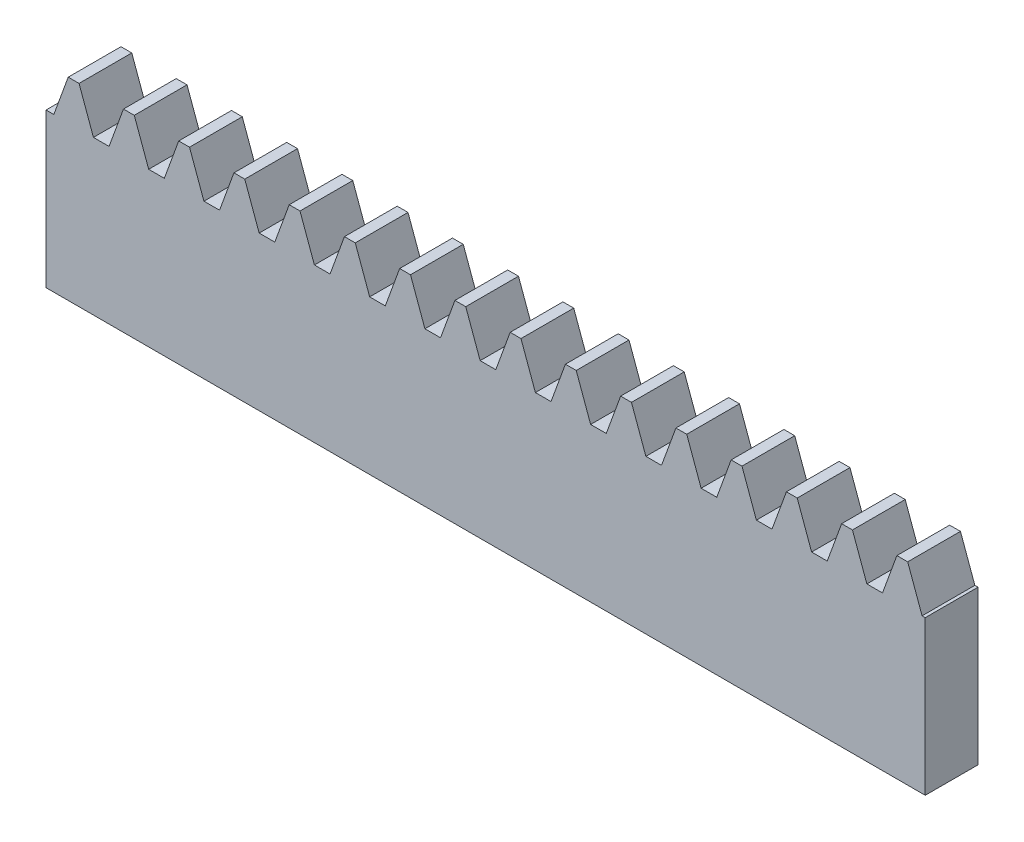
ISO-10303-21;
HEADER;
FILE_DESCRIPTION(('STEP AP214'),'2;1');
FILE_NAME('part.step','',(''),(''),'','','');
FILE_SCHEMA(('AUTOMOTIVE_DESIGN { 1 0 10303 214 1 1 1 1 }'));
ENDSEC;
DATA;
#1=APPLICATION_CONTEXT('core data for automotive mechanical design processes');
#2=APPLICATION_PROTOCOL_DEFINITION('international standard','automotive_design',2000,#1);
#3=PRODUCT_CONTEXT('',#1,'mechanical');
#4=PRODUCT('Part','Part','',(#3));
#5=PRODUCT_RELATED_PRODUCT_CATEGORY('part','',(#4));
#6=PRODUCT_DEFINITION_FORMATION('','',#4);
#7=PRODUCT_DEFINITION_CONTEXT('part definition',#1,'design');
#8=PRODUCT_DEFINITION('design','',#6,#7);
#9=PRODUCT_DEFINITION_SHAPE('','',#8);
#10=(LENGTH_UNIT() NAMED_UNIT(*) SI_UNIT(.MILLI.,.METRE.));
#11=(NAMED_UNIT(*) PLANE_ANGLE_UNIT() SI_UNIT($,.RADIAN.));
#12=(NAMED_UNIT(*) SI_UNIT($,.STERADIAN.) SOLID_ANGLE_UNIT());
#13=UNCERTAINTY_MEASURE_WITH_UNIT(LENGTH_MEASURE(1.E-05),#10,'distance_accuracy_value','');
#14=(GEOMETRIC_REPRESENTATION_CONTEXT(3) GLOBAL_UNCERTAINTY_ASSIGNED_CONTEXT((#13)) GLOBAL_UNIT_ASSIGNED_CONTEXT((#10,
#11,#12)) REPRESENTATION_CONTEXT('',''));
#15=CARTESIAN_POINT('',(0.,0.,0.));
#16=DIRECTION('',(0.,0.,1.));
#17=DIRECTION('',(1.,0.,0.));
#18=AXIS2_PLACEMENT_3D('',#15,#16,#17);
#19=CARTESIAN_POINT('',(0.,11.,-3.));
#20=DIRECTION('',(0.,1.,0.));
#21=DIRECTION('',(0.,0.,1.));
#22=AXIS2_PLACEMENT_3D('',#19,#20,#21);
#23=PLANE('',#22);
#24=DIRECTION('',(0.,0.,1.));
#25=VECTOR('',#24,1.);
#26=CARTESIAN_POINT('',(45.8605213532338,11.,-3.));
#27=LINE('',#26,#25);
#28=CARTESIAN_POINT('',(45.8605213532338,11.,-3.));
#29=VERTEX_POINT('',#28);
#30=CARTESIAN_POINT('',(45.8605213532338,11.,0.));
#31=VERTEX_POINT('',#30);
#32=EDGE_CURVE('E502',#29,#31,#27,.T.);
#33=ORIENTED_EDGE('',*,*,#32,.F.);
#34=DIRECTION('',(-1.,0.,0.));
#35=VECTOR('',#34,1.);
#36=CARTESIAN_POINT('',(0.,11.,-3.));
#37=LINE('',#36,#35);
#38=CARTESIAN_POINT('',(45.2456654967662,11.,-3.));
#39=VERTEX_POINT('',#38);
#40=EDGE_CURVE('E869',#29,#39,#37,.T.);
#41=ORIENTED_EDGE('',*,*,#40,.T.);
#42=DIRECTION('',(0.,0.,-1.));
#43=VECTOR('',#42,1.);
#44=CARTESIAN_POINT('',(45.2456654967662,11.,-3.));
#45=LINE('',#44,#43);
#46=CARTESIAN_POINT('',(45.2456654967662,11.,0.));
#47=VERTEX_POINT('',#46);
#48=EDGE_CURVE('E522',#47,#39,#45,.T.);
#49=ORIENTED_EDGE('',*,*,#48,.F.);
#50=DIRECTION('',(-1.,0.,0.));
#51=VECTOR('',#50,1.);
#52=CARTESIAN_POINT('',(0.,11.,0.));
#53=LINE('',#52,#51);
#54=EDGE_CURVE('E879',#31,#47,#53,.T.);
#55=ORIENTED_EDGE('',*,*,#54,.F.);
#56=EDGE_LOOP('',(#33,#41,#49,#55));
#57=FACE_BOUND('',#56,.T.);
#58=ADVANCED_FACE('F33',(#57),#23,.T.);
#59=DIRECTION('',(0.,0.,1.));
#60=VECTOR('',#59,1.);
#61=CARTESIAN_POINT('',(42.7189287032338,11.,-3.));
#62=LINE('',#61,#60);
#63=CARTESIAN_POINT('',(42.7189287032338,11.,-3.));
#64=VERTEX_POINT('',#63);
#65=CARTESIAN_POINT('',(42.7189287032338,11.,0.));
#66=VERTEX_POINT('',#65);
#67=EDGE_CURVE('E526',#64,#66,#62,.T.);
#68=ORIENTED_EDGE('',*,*,#67,.F.);
#69=CARTESIAN_POINT('',(42.1040728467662,11.,-3.));
#70=VERTEX_POINT('',#69);
#71=EDGE_CURVE('E1047',#64,#70,#37,.T.);
#72=ORIENTED_EDGE('',*,*,#71,.T.);
#73=DIRECTION('',(0.,0.,-1.));
#74=VECTOR('',#73,1.);
#75=CARTESIAN_POINT('',(42.1040728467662,11.,-3.));
#76=LINE('',#75,#74);
#77=CARTESIAN_POINT('',(42.1040728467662,11.,0.));
#78=VERTEX_POINT('',#77);
#79=EDGE_CURVE('E546',#78,#70,#76,.T.);
#80=ORIENTED_EDGE('',*,*,#79,.F.);
#81=EDGE_CURVE('E940',#66,#78,#53,.T.);
#82=ORIENTED_EDGE('',*,*,#81,.F.);
#83=EDGE_LOOP('',(#68,#72,#80,#82));
#84=FACE_BOUND('',#83,.T.);
#85=ADVANCED_FACE('F1065',(#84),#23,.T.);
#86=DIRECTION('',(0.,0.,1.));
#87=VECTOR('',#86,1.);
#88=CARTESIAN_POINT('',(39.5773360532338,11.,-3.));
#89=LINE('',#88,#87);
#90=CARTESIAN_POINT('',(39.5773360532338,11.,-3.));
#91=VERTEX_POINT('',#90);
#92=CARTESIAN_POINT('',(39.5773360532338,11.,0.));
#93=VERTEX_POINT('',#92);
#94=EDGE_CURVE('E550',#91,#93,#89,.T.);
#95=ORIENTED_EDGE('',*,*,#94,.F.);
#96=CARTESIAN_POINT('',(38.9624801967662,11.,-3.));
#97=VERTEX_POINT('',#96);
#98=EDGE_CURVE('E1042',#91,#97,#37,.T.);
#99=ORIENTED_EDGE('',*,*,#98,.T.);
#100=DIRECTION('',(0.,0.,-1.));
#101=VECTOR('',#100,1.);
#102=CARTESIAN_POINT('',(38.9624801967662,11.,-3.));
#103=LINE('',#102,#101);
#104=CARTESIAN_POINT('',(38.9624801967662,11.,0.));
#105=VERTEX_POINT('',#104);
#106=EDGE_CURVE('E570',#105,#97,#103,.T.);
#107=ORIENTED_EDGE('',*,*,#106,.F.);
#108=EDGE_CURVE('E941',#93,#105,#53,.T.);
#109=ORIENTED_EDGE('',*,*,#108,.F.);
#110=EDGE_LOOP('',(#95,#99,#107,#109));
#111=FACE_BOUND('',#110,.T.);
#112=ADVANCED_FACE('F1075',(#111),#23,.T.);
#113=DIRECTION('',(0.,0.,1.));
#114=VECTOR('',#113,1.);
#115=CARTESIAN_POINT('',(36.4357434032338,11.,-3.));
#116=LINE('',#115,#114);
#117=CARTESIAN_POINT('',(36.4357434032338,11.,-3.));
#118=VERTEX_POINT('',#117);
#119=CARTESIAN_POINT('',(36.4357434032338,11.,0.));
#120=VERTEX_POINT('',#119);
#121=EDGE_CURVE('E574',#118,#120,#116,.T.);
#122=ORIENTED_EDGE('',*,*,#121,.F.);
#123=CARTESIAN_POINT('',(35.8208875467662,11.,-3.));
#124=VERTEX_POINT('',#123);
#125=EDGE_CURVE('E1037',#118,#124,#37,.T.);
#126=ORIENTED_EDGE('',*,*,#125,.T.);
#127=DIRECTION('',(0.,0.,-1.));
#128=VECTOR('',#127,1.);
#129=CARTESIAN_POINT('',(35.8208875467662,11.,-3.));
#130=LINE('',#129,#128);
#131=CARTESIAN_POINT('',(35.8208875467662,11.,0.));
#132=VERTEX_POINT('',#131);
#133=EDGE_CURVE('E594',#132,#124,#130,.T.);
#134=ORIENTED_EDGE('',*,*,#133,.F.);
#135=EDGE_CURVE('E944',#120,#132,#53,.T.);
#136=ORIENTED_EDGE('',*,*,#135,.F.);
#137=EDGE_LOOP('',(#122,#126,#134,#136));
#138=FACE_BOUND('',#137,.T.);
#139=ADVANCED_FACE('F1085',(#138),#23,.T.);
#140=DIRECTION('',(0.,0.,1.));
#141=VECTOR('',#140,1.);
#142=CARTESIAN_POINT('',(33.2941507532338,11.,-3.));
#143=LINE('',#142,#141);
#144=CARTESIAN_POINT('',(33.2941507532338,11.,-3.));
#145=VERTEX_POINT('',#144);
#146=CARTESIAN_POINT('',(33.2941507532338,11.,0.));
#147=VERTEX_POINT('',#146);
#148=EDGE_CURVE('E598',#145,#147,#143,.T.);
#149=ORIENTED_EDGE('',*,*,#148,.F.);
#150=CARTESIAN_POINT('',(32.6792948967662,11.,-3.));
#151=VERTEX_POINT('',#150);
#152=EDGE_CURVE('E1032',#145,#151,#37,.T.);
#153=ORIENTED_EDGE('',*,*,#152,.T.);
#154=DIRECTION('',(0.,0.,-1.));
#155=VECTOR('',#154,1.);
#156=CARTESIAN_POINT('',(32.6792948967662,11.,-3.));
#157=LINE('',#156,#155);
#158=CARTESIAN_POINT('',(32.6792948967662,11.,0.));
#159=VERTEX_POINT('',#158);
#160=EDGE_CURVE('E618',#159,#151,#157,.T.);
#161=ORIENTED_EDGE('',*,*,#160,.F.);
#162=EDGE_CURVE('E947',#147,#159,#53,.T.);
#163=ORIENTED_EDGE('',*,*,#162,.F.);
#164=EDGE_LOOP('',(#149,#153,#161,#163));
#165=FACE_BOUND('',#164,.T.);
#166=ADVANCED_FACE('F1095',(#165),#23,.T.);
#167=DIRECTION('',(0.,0.,1.));
#168=VECTOR('',#167,1.);
#169=CARTESIAN_POINT('',(30.1525581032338,11.,-3.));
#170=LINE('',#169,#168);
#171=CARTESIAN_POINT('',(30.1525581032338,11.,-3.));
#172=VERTEX_POINT('',#171);
#173=CARTESIAN_POINT('',(30.1525581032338,11.,0.));
#174=VERTEX_POINT('',#173);
#175=EDGE_CURVE('E622',#172,#174,#170,.T.);
#176=ORIENTED_EDGE('',*,*,#175,.F.);
#177=CARTESIAN_POINT('',(29.5377022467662,11.,-3.));
#178=VERTEX_POINT('',#177);
#179=EDGE_CURVE('E1027',#172,#178,#37,.T.);
#180=ORIENTED_EDGE('',*,*,#179,.T.);
#181=DIRECTION('',(0.,0.,-1.));
#182=VECTOR('',#181,1.);
#183=CARTESIAN_POINT('',(29.5377022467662,11.,-3.));
#184=LINE('',#183,#182);
#185=CARTESIAN_POINT('',(29.5377022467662,11.,0.));
#186=VERTEX_POINT('',#185);
#187=EDGE_CURVE('E642',#186,#178,#184,.T.);
#188=ORIENTED_EDGE('',*,*,#187,.F.);
#189=EDGE_CURVE('E950',#174,#186,#53,.T.);
#190=ORIENTED_EDGE('',*,*,#189,.F.);
#191=EDGE_LOOP('',(#176,#180,#188,#190));
#192=FACE_BOUND('',#191,.T.);
#193=ADVANCED_FACE('F1105',(#192),#23,.T.);
#194=DIRECTION('',(0.,0.,1.));
#195=VECTOR('',#194,1.);
#196=CARTESIAN_POINT('',(27.0109654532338,11.,-3.));
#197=LINE('',#196,#195);
#198=CARTESIAN_POINT('',(27.0109654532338,11.,-3.));
#199=VERTEX_POINT('',#198);
#200=CARTESIAN_POINT('',(27.0109654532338,11.,0.));
#201=VERTEX_POINT('',#200);
#202=EDGE_CURVE('E646',#199,#201,#197,.T.);
#203=ORIENTED_EDGE('',*,*,#202,.F.);
#204=CARTESIAN_POINT('',(26.3961095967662,11.,-3.));
#205=VERTEX_POINT('',#204);
#206=EDGE_CURVE('E1022',#199,#205,#37,.T.);
#207=ORIENTED_EDGE('',*,*,#206,.T.);
#208=DIRECTION('',(0.,0.,-1.));
#209=VECTOR('',#208,1.);
#210=CARTESIAN_POINT('',(26.3961095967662,11.,-3.));
#211=LINE('',#210,#209);
#212=CARTESIAN_POINT('',(26.3961095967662,11.,0.));
#213=VERTEX_POINT('',#212);
#214=EDGE_CURVE('E666',#213,#205,#211,.T.);
#215=ORIENTED_EDGE('',*,*,#214,.F.);
#216=EDGE_CURVE('E953',#201,#213,#53,.T.);
#217=ORIENTED_EDGE('',*,*,#216,.F.);
#218=EDGE_LOOP('',(#203,#207,#215,#217));
#219=FACE_BOUND('',#218,.T.);
#220=ADVANCED_FACE('F1115',(#219),#23,.T.);
#221=DIRECTION('',(0.,0.,1.));
#222=VECTOR('',#221,1.);
#223=CARTESIAN_POINT('',(23.8693728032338,11.,-3.));
#224=LINE('',#223,#222);
#225=CARTESIAN_POINT('',(23.8693728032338,11.,-3.));
#226=VERTEX_POINT('',#225);
#227=CARTESIAN_POINT('',(23.8693728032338,11.,0.));
#228=VERTEX_POINT('',#227);
#229=EDGE_CURVE('E670',#226,#228,#224,.T.);
#230=ORIENTED_EDGE('',*,*,#229,.F.);
#231=CARTESIAN_POINT('',(23.2545169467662,11.,-3.));
#232=VERTEX_POINT('',#231);
#233=EDGE_CURVE('E1017',#226,#232,#37,.T.);
#234=ORIENTED_EDGE('',*,*,#233,.T.);
#235=DIRECTION('',(0.,0.,-1.));
#236=VECTOR('',#235,1.);
#237=CARTESIAN_POINT('',(23.2545169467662,11.,-3.));
#238=LINE('',#237,#236);
#239=CARTESIAN_POINT('',(23.2545169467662,11.,0.));
#240=VERTEX_POINT('',#239);
#241=EDGE_CURVE('E690',#240,#232,#238,.T.);
#242=ORIENTED_EDGE('',*,*,#241,.F.);
#243=EDGE_CURVE('E956',#228,#240,#53,.T.);
#244=ORIENTED_EDGE('',*,*,#243,.F.);
#245=EDGE_LOOP('',(#230,#234,#242,#244));
#246=FACE_BOUND('',#245,.T.);
#247=ADVANCED_FACE('F1125',(#246),#23,.T.);
#248=DIRECTION('',(0.,0.,1.));
#249=VECTOR('',#248,1.);
#250=CARTESIAN_POINT('',(20.7277801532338,11.,-3.));
#251=LINE('',#250,#249);
#252=CARTESIAN_POINT('',(20.7277801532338,11.,-3.));
#253=VERTEX_POINT('',#252);
#254=CARTESIAN_POINT('',(20.7277801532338,11.,0.));
#255=VERTEX_POINT('',#254);
#256=EDGE_CURVE('E694',#253,#255,#251,.T.);
#257=ORIENTED_EDGE('',*,*,#256,.F.);
#258=CARTESIAN_POINT('',(20.1129242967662,11.,-3.));
#259=VERTEX_POINT('',#258);
#260=EDGE_CURVE('E1012',#253,#259,#37,.T.);
#261=ORIENTED_EDGE('',*,*,#260,.T.);
#262=DIRECTION('',(0.,0.,-1.));
#263=VECTOR('',#262,1.);
#264=CARTESIAN_POINT('',(20.1129242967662,11.,-3.));
#265=LINE('',#264,#263);
#266=CARTESIAN_POINT('',(20.1129242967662,11.,0.));
#267=VERTEX_POINT('',#266);
#268=EDGE_CURVE('E714',#267,#259,#265,.T.);
#269=ORIENTED_EDGE('',*,*,#268,.F.);
#270=EDGE_CURVE('E959',#255,#267,#53,.T.);
#271=ORIENTED_EDGE('',*,*,#270,.F.);
#272=EDGE_LOOP('',(#257,#261,#269,#271));
#273=FACE_BOUND('',#272,.T.);
#274=ADVANCED_FACE('F1135',(#273),#23,.T.);
#275=DIRECTION('',(0.,0.,1.));
#276=VECTOR('',#275,1.);
#277=CARTESIAN_POINT('',(17.5861875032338,11.,-3.));
#278=LINE('',#277,#276);
#279=CARTESIAN_POINT('',(17.5861875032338,11.,-3.));
#280=VERTEX_POINT('',#279);
#281=CARTESIAN_POINT('',(17.5861875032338,11.,0.));
#282=VERTEX_POINT('',#281);
#283=EDGE_CURVE('E718',#280,#282,#278,.T.);
#284=ORIENTED_EDGE('',*,*,#283,.F.);
#285=CARTESIAN_POINT('',(16.9713316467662,11.,-3.));
#286=VERTEX_POINT('',#285);
#287=EDGE_CURVE('E1007',#280,#286,#37,.T.);
#288=ORIENTED_EDGE('',*,*,#287,.T.);
#289=DIRECTION('',(0.,0.,-1.));
#290=VECTOR('',#289,1.);
#291=CARTESIAN_POINT('',(16.9713316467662,11.,-3.));
#292=LINE('',#291,#290);
#293=CARTESIAN_POINT('',(16.9713316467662,11.,0.));
#294=VERTEX_POINT('',#293);
#295=EDGE_CURVE('E738',#294,#286,#292,.T.);
#296=ORIENTED_EDGE('',*,*,#295,.F.);
#297=EDGE_CURVE('E962',#282,#294,#53,.T.);
#298=ORIENTED_EDGE('',*,*,#297,.F.);
#299=EDGE_LOOP('',(#284,#288,#296,#298));
#300=FACE_BOUND('',#299,.T.);
#301=ADVANCED_FACE('F1145',(#300),#23,.T.);
#302=DIRECTION('',(0.,0.,1.));
#303=VECTOR('',#302,1.);
#304=CARTESIAN_POINT('',(14.4445948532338,11.,-3.));
#305=LINE('',#304,#303);
#306=CARTESIAN_POINT('',(14.4445948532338,11.,-3.));
#307=VERTEX_POINT('',#306);
#308=CARTESIAN_POINT('',(14.4445948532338,11.,0.));
#309=VERTEX_POINT('',#308);
#310=EDGE_CURVE('E742',#307,#309,#305,.T.);
#311=ORIENTED_EDGE('',*,*,#310,.F.);
#312=CARTESIAN_POINT('',(13.8297389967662,11.,-3.));
#313=VERTEX_POINT('',#312);
#314=EDGE_CURVE('E1002',#307,#313,#37,.T.);
#315=ORIENTED_EDGE('',*,*,#314,.T.);
#316=DIRECTION('',(0.,0.,-1.));
#317=VECTOR('',#316,1.);
#318=CARTESIAN_POINT('',(13.8297389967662,11.,-3.));
#319=LINE('',#318,#317);
#320=CARTESIAN_POINT('',(13.8297389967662,11.,0.));
#321=VERTEX_POINT('',#320);
#322=EDGE_CURVE('E762',#321,#313,#319,.T.);
#323=ORIENTED_EDGE('',*,*,#322,.F.);
#324=EDGE_CURVE('E965',#309,#321,#53,.T.);
#325=ORIENTED_EDGE('',*,*,#324,.F.);
#326=EDGE_LOOP('',(#311,#315,#323,#325));
#327=FACE_BOUND('',#326,.T.);
#328=ADVANCED_FACE('F1155',(#327),#23,.T.);
#329=DIRECTION('',(0.,0.,1.));
#330=VECTOR('',#329,1.);
#331=CARTESIAN_POINT('',(11.3030022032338,11.,-3.));
#332=LINE('',#331,#330);
#333=CARTESIAN_POINT('',(11.3030022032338,11.,-3.));
#334=VERTEX_POINT('',#333);
#335=CARTESIAN_POINT('',(11.3030022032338,11.,0.));
#336=VERTEX_POINT('',#335);
#337=EDGE_CURVE('E766',#334,#336,#332,.T.);
#338=ORIENTED_EDGE('',*,*,#337,.F.);
#339=CARTESIAN_POINT('',(10.6881463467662,11.,-3.));
#340=VERTEX_POINT('',#339);
#341=EDGE_CURVE('E997',#334,#340,#37,.T.);
#342=ORIENTED_EDGE('',*,*,#341,.T.);
#343=DIRECTION('',(0.,0.,-1.));
#344=VECTOR('',#343,1.);
#345=CARTESIAN_POINT('',(10.6881463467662,11.,-3.));
#346=LINE('',#345,#344);
#347=CARTESIAN_POINT('',(10.6881463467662,11.,0.));
#348=VERTEX_POINT('',#347);
#349=EDGE_CURVE('E786',#348,#340,#346,.T.);
#350=ORIENTED_EDGE('',*,*,#349,.F.);
#351=EDGE_CURVE('E968',#336,#348,#53,.T.);
#352=ORIENTED_EDGE('',*,*,#351,.F.);
#353=EDGE_LOOP('',(#338,#342,#350,#352));
#354=FACE_BOUND('',#353,.T.);
#355=ADVANCED_FACE('F1165',(#354),#23,.T.);
#356=DIRECTION('',(0.,0.,1.));
#357=VECTOR('',#356,1.);
#358=CARTESIAN_POINT('',(8.16140955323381,11.,-3.));
#359=LINE('',#358,#357);
#360=CARTESIAN_POINT('',(8.16140955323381,11.,-3.));
#361=VERTEX_POINT('',#360);
#362=CARTESIAN_POINT('',(8.16140955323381,11.,0.));
#363=VERTEX_POINT('',#362);
#364=EDGE_CURVE('E790',#361,#363,#359,.T.);
#365=ORIENTED_EDGE('',*,*,#364,.F.);
#366=CARTESIAN_POINT('',(7.5465536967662,11.,-3.));
#367=VERTEX_POINT('',#366);
#368=EDGE_CURVE('E992',#361,#367,#37,.T.);
#369=ORIENTED_EDGE('',*,*,#368,.T.);
#370=DIRECTION('',(0.,0.,-1.));
#371=VECTOR('',#370,1.);
#372=CARTESIAN_POINT('',(7.5465536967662,11.,-3.));
#373=LINE('',#372,#371);
#374=CARTESIAN_POINT('',(7.5465536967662,11.,0.));
#375=VERTEX_POINT('',#374);
#376=EDGE_CURVE('E810',#375,#367,#373,.T.);
#377=ORIENTED_EDGE('',*,*,#376,.F.);
#378=EDGE_CURVE('E971',#363,#375,#53,.T.);
#379=ORIENTED_EDGE('',*,*,#378,.F.);
#380=EDGE_LOOP('',(#365,#369,#377,#379));
#381=FACE_BOUND('',#380,.T.);
#382=ADVANCED_FACE('F1175',(#381),#23,.T.);
#383=DIRECTION('',(0.,0.,1.));
#384=VECTOR('',#383,1.);
#385=CARTESIAN_POINT('',(5.01981690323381,11.,-3.));
#386=LINE('',#385,#384);
#387=CARTESIAN_POINT('',(5.01981690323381,11.,-3.));
#388=VERTEX_POINT('',#387);
#389=CARTESIAN_POINT('',(5.01981690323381,11.,0.));
#390=VERTEX_POINT('',#389);
#391=EDGE_CURVE('E814',#388,#390,#386,.T.);
#392=ORIENTED_EDGE('',*,*,#391,.F.);
#393=CARTESIAN_POINT('',(4.4049610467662,11.,-3.));
#394=VERTEX_POINT('',#393);
#395=EDGE_CURVE('E991',#388,#394,#37,.T.);
#396=ORIENTED_EDGE('',*,*,#395,.T.);
#397=DIRECTION('',(0.,0.,-1.));
#398=VECTOR('',#397,1.);
#399=CARTESIAN_POINT('',(4.4049610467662,11.,-3.));
#400=LINE('',#399,#398);
#401=CARTESIAN_POINT('',(4.4049610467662,11.,0.));
#402=VERTEX_POINT('',#401);
#403=EDGE_CURVE('E834',#402,#394,#400,.T.);
#404=ORIENTED_EDGE('',*,*,#403,.F.);
#405=EDGE_CURVE('E974',#390,#402,#53,.T.);
#406=ORIENTED_EDGE('',*,*,#405,.F.);
#407=EDGE_LOOP('',(#392,#396,#404,#406));
#408=FACE_BOUND('',#407,.T.);
#409=ADVANCED_FACE('F1185',(#408),#23,.T.);
#410=DIRECTION('',(0.,0.,1.));
#411=VECTOR('',#410,1.);
#412=CARTESIAN_POINT('',(1.8782242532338,11.,-3.));
#413=LINE('',#412,#411);
#414=CARTESIAN_POINT('',(1.8782242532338,11.,-3.));
#415=VERTEX_POINT('',#414);
#416=CARTESIAN_POINT('',(1.8782242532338,11.,0.));
#417=VERTEX_POINT('',#416);
#418=EDGE_CURVE('E838',#415,#417,#413,.T.);
#419=ORIENTED_EDGE('',*,*,#418,.F.);
#420=CARTESIAN_POINT('',(1.2633683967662,11.,-3.));
#421=VERTEX_POINT('',#420);
#422=EDGE_CURVE('E866',#415,#421,#37,.T.);
#423=ORIENTED_EDGE('',*,*,#422,.T.);
#424=DIRECTION('',(0.,0.,-1.));
#425=VECTOR('',#424,1.);
#426=CARTESIAN_POINT('',(1.2633683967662,11.,-3.));
#427=LINE('',#426,#425);
#428=CARTESIAN_POINT('',(1.2633683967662,11.,0.));
#429=VERTEX_POINT('',#428);
#430=EDGE_CURVE('E854',#429,#421,#427,.T.);
#431=ORIENTED_EDGE('',*,*,#430,.F.);
#432=EDGE_CURVE('E877',#417,#429,#53,.T.);
#433=ORIENTED_EDGE('',*,*,#432,.F.);
#434=EDGE_LOOP('',(#419,#423,#431,#433));
#435=FACE_BOUND('',#434,.T.);
#436=ADVANCED_FACE('F989',(#435),#23,.T.);
#437=CARTESIAN_POINT('',(0.,0.,-3.));
#438=DIRECTION('',(-1.,0.,0.));
#439=DIRECTION('',(0.,0.,1.));
#440=AXIS2_PLACEMENT_3D('',#437,#438,#439);
#441=PLANE('',#440);
#442=DIRECTION('',(0.,0.,1.));
#443=VECTOR('',#442,1.);
#444=CARTESIAN_POINT('',(0.,8.75,-3.));
#445=LINE('',#444,#443);
#446=CARTESIAN_POINT('',(0.,8.75,-3.));
#447=VERTEX_POINT('',#446);
#448=CARTESIAN_POINT('',(0.,8.75,0.));
#449=VERTEX_POINT('',#448);
#450=EDGE_CURVE('E852',#447,#449,#445,.T.);
#451=ORIENTED_EDGE('',*,*,#450,.F.);
#452=DIRECTION('',(0.,-1.,0.));
#453=VECTOR('',#452,1.);
#454=CARTESIAN_POINT('',(0.,0.,-3.));
#455=LINE('',#454,#453);
#456=CARTESIAN_POINT('',(0.,0.,-3.));
#457=VERTEX_POINT('',#456);
#458=EDGE_CURVE('E858',#447,#457,#455,.T.);
#459=ORIENTED_EDGE('',*,*,#458,.T.);
#460=DIRECTION('',(0.,0.,1.));
#461=VECTOR('',#460,1.);
#462=CARTESIAN_POINT('',(0.,0.,-3.));
#463=LINE('',#462,#461);
#464=CARTESIAN_POINT('',(0.,0.,0.));
#465=VERTEX_POINT('',#464);
#466=EDGE_CURVE('E868',#457,#465,#463,.T.);
#467=ORIENTED_EDGE('',*,*,#466,.T.);
#468=DIRECTION('',(0.,-1.,0.));
#469=VECTOR('',#468,1.);
#470=CARTESIAN_POINT('',(0.,0.,0.));
#471=LINE('',#470,#469);
#472=EDGE_CURVE('E857',#449,#465,#471,.T.);
#473=ORIENTED_EDGE('',*,*,#472,.F.);
#474=EDGE_LOOP('',(#451,#459,#467,#473));
#475=FACE_BOUND('',#474,.T.);
#476=ADVANCED_FACE('F35',(#475),#441,.T.);
#477=DIRECTION('',(0.,0.,1.));
#478=VECTOR('',#477,1.);
#479=CARTESIAN_POINT('',(49.0021140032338,11.,-3.));
#480=LINE('',#479,#478);
#481=CARTESIAN_POINT('',(49.0021140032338,11.,-3.));
#482=VERTEX_POINT('',#481);
#483=CARTESIAN_POINT('',(49.0021140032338,11.,0.));
#484=VERTEX_POINT('',#483);
#485=EDGE_CURVE('E481',#482,#484,#480,.T.);
#486=ORIENTED_EDGE('',*,*,#485,.F.);
#487=CARTESIAN_POINT('',(48.3872581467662,11.,-3.));
#488=VERTEX_POINT('',#487);
#489=EDGE_CURVE('E475',#482,#488,#37,.T.);
#490=ORIENTED_EDGE('',*,*,#489,.T.);
#491=DIRECTION('',(0.,0.,-1.));
#492=VECTOR('',#491,1.);
#493=CARTESIAN_POINT('',(48.3872581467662,11.,-3.));
#494=LINE('',#493,#492);
#495=CARTESIAN_POINT('',(48.3872581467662,11.,0.));
#496=VERTEX_POINT('',#495);
#497=EDGE_CURVE('E498',#496,#488,#494,.T.);
#498=ORIENTED_EDGE('',*,*,#497,.F.);
#499=EDGE_CURVE('E861',#484,#496,#53,.T.);
#500=ORIENTED_EDGE('',*,*,#499,.F.);
#501=EDGE_LOOP('',(#486,#490,#498,#500));
#502=FACE_BOUND('',#501,.T.);
#503=ADVANCED_FACE('F1208',(#502),#23,.T.);
#504=CARTESIAN_POINT('',(50.,0.,-3.));
#505=DIRECTION('',(1.,0.,0.));
#506=DIRECTION('',(0.,0.,-1.));
#507=AXIS2_PLACEMENT_3D('',#504,#505,#506);
#508=PLANE('',#507);
#509=DIRECTION('',(0.,0.,-1.));
#510=VECTOR('',#509,1.);
#511=CARTESIAN_POINT('',(50.,8.75,-3.));
#512=LINE('',#511,#510);
#513=CARTESIAN_POINT('',(50.,8.75,0.));
#514=VERTEX_POINT('',#513);
#515=CARTESIAN_POINT('',(50.,8.75,-3.));
#516=VERTEX_POINT('',#515);
#517=EDGE_CURVE('E462',#514,#516,#512,.T.);
#518=ORIENTED_EDGE('',*,*,#517,.F.);
#519=DIRECTION('',(0.,1.,0.));
#520=VECTOR('',#519,1.);
#521=CARTESIAN_POINT('',(50.,0.,0.));
#522=LINE('',#521,#520);
#523=CARTESIAN_POINT('',(50.,0.,0.));
#524=VERTEX_POINT('',#523);
#525=EDGE_CURVE('E874',#524,#514,#522,.T.);
#526=ORIENTED_EDGE('',*,*,#525,.F.);
#527=DIRECTION('',(0.,0.,1.));
#528=VECTOR('',#527,1.);
#529=CARTESIAN_POINT('',(50.,0.,-3.));
#530=LINE('',#529,#528);
#531=CARTESIAN_POINT('',(50.,0.,-3.));
#532=VERTEX_POINT('',#531);
#533=EDGE_CURVE('E880',#532,#524,#530,.T.);
#534=ORIENTED_EDGE('',*,*,#533,.F.);
#535=DIRECTION('',(0.,1.,0.));
#536=VECTOR('',#535,1.);
#537=CARTESIAN_POINT('',(50.,0.,-3.));
#538=LINE('',#537,#536);
#539=EDGE_CURVE('E864',#532,#516,#538,.T.);
#540=ORIENTED_EDGE('',*,*,#539,.T.);
#541=EDGE_LOOP('',(#518,#526,#534,#540));
#542=FACE_BOUND('',#541,.T.);
#543=ADVANCED_FACE('F1215',(#542),#508,.T.);
#544=CARTESIAN_POINT('',(0.,0.,-3.));
#545=DIRECTION('',(0.,-1.,0.));
#546=DIRECTION('',(0.,0.,-1.));
#547=AXIS2_PLACEMENT_3D('',#544,#545,#546);
#548=PLANE('',#547);
#549=DIRECTION('',(1.,0.,0.));
#550=VECTOR('',#549,1.);
#551=CARTESIAN_POINT('',(0.,0.,0.));
#552=LINE('',#551,#550);
#553=EDGE_CURVE('E871',#465,#524,#552,.T.);
#554=ORIENTED_EDGE('',*,*,#553,.F.);
#555=ORIENTED_EDGE('',*,*,#466,.F.);
#556=DIRECTION('',(1.,0.,0.));
#557=VECTOR('',#556,1.);
#558=CARTESIAN_POINT('',(0.,0.,-3.));
#559=LINE('',#558,#557);
#560=EDGE_CURVE('E860',#457,#532,#559,.T.);
#561=ORIENTED_EDGE('',*,*,#560,.T.);
#562=ORIENTED_EDGE('',*,*,#533,.T.);
#563=EDGE_LOOP('',(#554,#555,#561,#562));
#564=FACE_BOUND('',#563,.T.);
#565=ADVANCED_FACE('F1221',(#564),#548,.T.);
#566=CARTESIAN_POINT('',(0.,11.,-3.));
#567=DIRECTION('',(0.,0.,-1.));
#568=DIRECTION('',(-1.,0.,0.));
#569=AXIS2_PLACEMENT_3D('',#566,#567,#568);
#570=PLANE('',#569);
#571=DIRECTION('',(0.342020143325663,-0.939692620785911,0.));
#572=VECTOR('',#571,1.);
#573=CARTESIAN_POINT('',(48.9928691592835,11.0254,-3.));
#574=LINE('',#573,#572);
#575=CARTESIAN_POINT('',(49.8210470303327,8.75,-3.));
#576=VERTEX_POINT('',#575);
#577=EDGE_CURVE('E459',#482,#576,#574,.T.);
#578=ORIENTED_EDGE('',*,*,#577,.T.);
#579=DIRECTION('',(1.,0.,0.));
#580=VECTOR('',#579,1.);
#581=CARTESIAN_POINT('',(50.7099177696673,8.75,-3.));
#582=LINE('',#581,#580);
#583=EDGE_CURVE('E463',#576,#516,#582,.T.);
#584=ORIENTED_EDGE('',*,*,#583,.T.);
#585=ORIENTED_EDGE('',*,*,#539,.F.);
#586=ORIENTED_EDGE('',*,*,#560,.F.);
#587=ORIENTED_EDGE('',*,*,#458,.F.);
#588=DIRECTION('',(1.,0.,0.));
#589=VECTOR('',#588,1.);
#590=CARTESIAN_POINT('',(0.444435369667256,8.75,-3.));
#591=LINE('',#590,#589);
#592=CARTESIAN_POINT('',(0.444435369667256,8.75,-3.));
#593=VERTEX_POINT('',#592);
#594=EDGE_CURVE('E841',#447,#593,#591,.T.);
#595=ORIENTED_EDGE('',*,*,#594,.T.);
#596=DIRECTION('',(0.342020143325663,0.939692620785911,0.));
#597=VECTOR('',#596,1.);
#598=CARTESIAN_POINT('',(1.27261324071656,11.0254,-3.));
#599=LINE('',#598,#597);
#600=EDGE_CURVE('E844',#593,#421,#599,.T.);
#601=ORIENTED_EDGE('',*,*,#600,.T.);
#602=ORIENTED_EDGE('',*,*,#422,.F.);
#603=DIRECTION('',(0.342020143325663,-0.939692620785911,0.));
#604=VECTOR('',#603,1.);
#605=CARTESIAN_POINT('',(1.86897940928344,11.0254,-3.));
#606=LINE('',#605,#604);
#607=CARTESIAN_POINT('',(2.69715728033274,8.75,-3.));
#608=VERTEX_POINT('',#607);
#609=EDGE_CURVE('E817',#415,#608,#606,.T.);
#610=ORIENTED_EDGE('',*,*,#609,.T.);
#611=DIRECTION('',(1.,0.,0.));
#612=VECTOR('',#611,1.);
#613=CARTESIAN_POINT('',(3.58602801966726,8.75,-3.));
#614=LINE('',#613,#612);
#615=CARTESIAN_POINT('',(3.58602801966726,8.75,-3.));
#616=VERTEX_POINT('',#615);
#617=EDGE_CURVE('E820',#608,#616,#614,.T.);
#618=ORIENTED_EDGE('',*,*,#617,.T.);
#619=DIRECTION('',(0.342020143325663,0.939692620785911,0.));
#620=VECTOR('',#619,1.);
#621=CARTESIAN_POINT('',(4.41420589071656,11.0254,-3.));
#622=LINE('',#621,#620);
#623=EDGE_CURVE('E824',#616,#394,#622,.T.);
#624=ORIENTED_EDGE('',*,*,#623,.T.);
#625=ORIENTED_EDGE('',*,*,#395,.F.);
#626=DIRECTION('',(0.342020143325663,-0.939692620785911,0.));
#627=VECTOR('',#626,1.);
#628=CARTESIAN_POINT('',(5.01057205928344,11.0254,-3.));
#629=LINE('',#628,#627);
#630=CARTESIAN_POINT('',(5.83874993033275,8.75,-3.));
#631=VERTEX_POINT('',#630);
#632=EDGE_CURVE('E793',#388,#631,#629,.T.);
#633=ORIENTED_EDGE('',*,*,#632,.T.);
#634=DIRECTION('',(1.,0.,0.));
#635=VECTOR('',#634,1.);
#636=CARTESIAN_POINT('',(6.72762066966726,8.75,-3.));
#637=LINE('',#636,#635);
#638=CARTESIAN_POINT('',(6.72762066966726,8.75,-3.));
#639=VERTEX_POINT('',#638);
#640=EDGE_CURVE('E796',#631,#639,#637,.T.);
#641=ORIENTED_EDGE('',*,*,#640,.T.);
#642=DIRECTION('',(0.342020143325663,0.939692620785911,0.));
#643=VECTOR('',#642,1.);
#644=CARTESIAN_POINT('',(7.55579854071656,11.0254,-3.));
#645=LINE('',#644,#643);
#646=EDGE_CURVE('E800',#639,#367,#645,.T.);
#647=ORIENTED_EDGE('',*,*,#646,.T.);
#648=ORIENTED_EDGE('',*,*,#368,.F.);
#649=DIRECTION('',(0.342020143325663,-0.939692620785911,0.));
#650=VECTOR('',#649,1.);
#651=CARTESIAN_POINT('',(8.15216470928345,11.0254,-3.));
#652=LINE('',#651,#650);
#653=CARTESIAN_POINT('',(8.98034258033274,8.75,-3.));
#654=VERTEX_POINT('',#653);
#655=EDGE_CURVE('E769',#361,#654,#652,.T.);
#656=ORIENTED_EDGE('',*,*,#655,.T.);
#657=DIRECTION('',(1.,0.,0.));
#658=VECTOR('',#657,1.);
#659=CARTESIAN_POINT('',(9.86921331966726,8.75,-3.));
#660=LINE('',#659,#658);
#661=CARTESIAN_POINT('',(9.86921331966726,8.75,-3.));
#662=VERTEX_POINT('',#661);
#663=EDGE_CURVE('E772',#654,#662,#660,.T.);
#664=ORIENTED_EDGE('',*,*,#663,.T.);
#665=DIRECTION('',(0.342020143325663,0.939692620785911,0.));
#666=VECTOR('',#665,1.);
#667=CARTESIAN_POINT('',(10.6973911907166,11.0254,-3.));
#668=LINE('',#667,#666);
#669=EDGE_CURVE('E776',#662,#340,#668,.T.);
#670=ORIENTED_EDGE('',*,*,#669,.T.);
#671=ORIENTED_EDGE('',*,*,#341,.F.);
#672=DIRECTION('',(0.342020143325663,-0.939692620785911,0.));
#673=VECTOR('',#672,1.);
#674=CARTESIAN_POINT('',(11.2937573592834,11.0254,-3.));
#675=LINE('',#674,#673);
#676=CARTESIAN_POINT('',(12.1219352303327,8.75,-3.));
#677=VERTEX_POINT('',#676);
#678=EDGE_CURVE('E745',#334,#677,#675,.T.);
#679=ORIENTED_EDGE('',*,*,#678,.T.);
#680=DIRECTION('',(1.,0.,0.));
#681=VECTOR('',#680,1.);
#682=CARTESIAN_POINT('',(13.0108059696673,8.75,-3.));
#683=LINE('',#682,#681);
#684=CARTESIAN_POINT('',(13.0108059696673,8.75,-3.));
#685=VERTEX_POINT('',#684);
#686=EDGE_CURVE('E748',#677,#685,#683,.T.);
#687=ORIENTED_EDGE('',*,*,#686,.T.);
#688=DIRECTION('',(0.342020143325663,0.939692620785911,0.));
#689=VECTOR('',#688,1.);
#690=CARTESIAN_POINT('',(13.8389838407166,11.0254,-3.));
#691=LINE('',#690,#689);
#692=EDGE_CURVE('E752',#685,#313,#691,.T.);
#693=ORIENTED_EDGE('',*,*,#692,.T.);
#694=ORIENTED_EDGE('',*,*,#314,.F.);
#695=DIRECTION('',(0.342020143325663,-0.939692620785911,0.));
#696=VECTOR('',#695,1.);
#697=CARTESIAN_POINT('',(14.4353500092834,11.0254,-3.));
#698=LINE('',#697,#696);
#699=CARTESIAN_POINT('',(15.2635278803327,8.75,-3.));
#700=VERTEX_POINT('',#699);
#701=EDGE_CURVE('E721',#307,#700,#698,.T.);
#702=ORIENTED_EDGE('',*,*,#701,.T.);
#703=DIRECTION('',(1.,0.,0.));
#704=VECTOR('',#703,1.);
#705=CARTESIAN_POINT('',(16.1523986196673,8.75,-3.));
#706=LINE('',#705,#704);
#707=CARTESIAN_POINT('',(16.1523986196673,8.75,-3.));
#708=VERTEX_POINT('',#707);
#709=EDGE_CURVE('E724',#700,#708,#706,.T.);
#710=ORIENTED_EDGE('',*,*,#709,.T.);
#711=DIRECTION('',(0.342020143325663,0.939692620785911,0.));
#712=VECTOR('',#711,1.);
#713=CARTESIAN_POINT('',(16.9805764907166,11.0254,-3.));
#714=LINE('',#713,#712);
#715=EDGE_CURVE('E728',#708,#286,#714,.T.);
#716=ORIENTED_EDGE('',*,*,#715,.T.);
#717=ORIENTED_EDGE('',*,*,#287,.F.);
#718=DIRECTION('',(0.342020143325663,-0.939692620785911,0.));
#719=VECTOR('',#718,1.);
#720=CARTESIAN_POINT('',(17.5769426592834,11.0254,-3.));
#721=LINE('',#720,#719);
#722=CARTESIAN_POINT('',(18.4051205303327,8.75,-3.));
#723=VERTEX_POINT('',#722);
#724=EDGE_CURVE('E697',#280,#723,#721,.T.);
#725=ORIENTED_EDGE('',*,*,#724,.T.);
#726=DIRECTION('',(1.,0.,0.));
#727=VECTOR('',#726,1.);
#728=CARTESIAN_POINT('',(19.2939912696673,8.75,-3.));
#729=LINE('',#728,#727);
#730=CARTESIAN_POINT('',(19.2939912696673,8.75,-3.));
#731=VERTEX_POINT('',#730);
#732=EDGE_CURVE('E700',#723,#731,#729,.T.);
#733=ORIENTED_EDGE('',*,*,#732,.T.);
#734=DIRECTION('',(0.342020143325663,0.939692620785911,0.));
#735=VECTOR('',#734,1.);
#736=CARTESIAN_POINT('',(20.1221691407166,11.0254,-3.));
#737=LINE('',#736,#735);
#738=EDGE_CURVE('E704',#731,#259,#737,.T.);
#739=ORIENTED_EDGE('',*,*,#738,.T.);
#740=ORIENTED_EDGE('',*,*,#260,.F.);
#741=DIRECTION('',(0.342020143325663,-0.939692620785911,0.));
#742=VECTOR('',#741,1.);
#743=CARTESIAN_POINT('',(20.7185353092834,11.0254,-3.));
#744=LINE('',#743,#742);
#745=CARTESIAN_POINT('',(21.5467131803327,8.75,-3.));
#746=VERTEX_POINT('',#745);
#747=EDGE_CURVE('E673',#253,#746,#744,.T.);
#748=ORIENTED_EDGE('',*,*,#747,.T.);
#749=DIRECTION('',(1.,0.,0.));
#750=VECTOR('',#749,1.);
#751=CARTESIAN_POINT('',(22.4355839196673,8.75,-3.));
#752=LINE('',#751,#750);
#753=CARTESIAN_POINT('',(22.4355839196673,8.75,-3.));
#754=VERTEX_POINT('',#753);
#755=EDGE_CURVE('E676',#746,#754,#752,.T.);
#756=ORIENTED_EDGE('',*,*,#755,.T.);
#757=DIRECTION('',(0.342020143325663,0.939692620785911,0.));
#758=VECTOR('',#757,1.);
#759=CARTESIAN_POINT('',(23.2637617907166,11.0254,-3.));
#760=LINE('',#759,#758);
#761=EDGE_CURVE('E680',#754,#232,#760,.T.);
#762=ORIENTED_EDGE('',*,*,#761,.T.);
#763=ORIENTED_EDGE('',*,*,#233,.F.);
#764=DIRECTION('',(0.342020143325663,-0.939692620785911,0.));
#765=VECTOR('',#764,1.);
#766=CARTESIAN_POINT('',(23.8601279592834,11.0254,-3.));
#767=LINE('',#766,#765);
#768=CARTESIAN_POINT('',(24.6883058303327,8.75,-3.));
#769=VERTEX_POINT('',#768);
#770=EDGE_CURVE('E649',#226,#769,#767,.T.);
#771=ORIENTED_EDGE('',*,*,#770,.T.);
#772=DIRECTION('',(1.,0.,0.));
#773=VECTOR('',#772,1.);
#774=CARTESIAN_POINT('',(25.5771765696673,8.75,-3.));
#775=LINE('',#774,#773);
#776=CARTESIAN_POINT('',(25.5771765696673,8.75,-3.));
#777=VERTEX_POINT('',#776);
#778=EDGE_CURVE('E652',#769,#777,#775,.T.);
#779=ORIENTED_EDGE('',*,*,#778,.T.);
#780=DIRECTION('',(0.342020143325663,0.939692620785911,0.));
#781=VECTOR('',#780,1.);
#782=CARTESIAN_POINT('',(26.4053544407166,11.0254,-3.));
#783=LINE('',#782,#781);
#784=EDGE_CURVE('E656',#777,#205,#783,.T.);
#785=ORIENTED_EDGE('',*,*,#784,.T.);
#786=ORIENTED_EDGE('',*,*,#206,.F.);
#787=DIRECTION('',(0.342020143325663,-0.939692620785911,0.));
#788=VECTOR('',#787,1.);
#789=CARTESIAN_POINT('',(27.0017206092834,11.0254,-3.));
#790=LINE('',#789,#788);
#791=CARTESIAN_POINT('',(27.8298984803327,8.75,-3.));
#792=VERTEX_POINT('',#791);
#793=EDGE_CURVE('E625',#199,#792,#790,.T.);
#794=ORIENTED_EDGE('',*,*,#793,.T.);
#795=DIRECTION('',(1.,0.,0.));
#796=VECTOR('',#795,1.);
#797=CARTESIAN_POINT('',(28.7187692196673,8.75,-3.));
#798=LINE('',#797,#796);
#799=CARTESIAN_POINT('',(28.7187692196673,8.75,-3.));
#800=VERTEX_POINT('',#799);
#801=EDGE_CURVE('E628',#792,#800,#798,.T.);
#802=ORIENTED_EDGE('',*,*,#801,.T.);
#803=DIRECTION('',(0.342020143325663,0.939692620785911,0.));
#804=VECTOR('',#803,1.);
#805=CARTESIAN_POINT('',(29.5469470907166,11.0254,-3.));
#806=LINE('',#805,#804);
#807=EDGE_CURVE('E632',#800,#178,#806,.T.);
#808=ORIENTED_EDGE('',*,*,#807,.T.);
#809=ORIENTED_EDGE('',*,*,#179,.F.);
#810=DIRECTION('',(0.342020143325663,-0.939692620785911,0.));
#811=VECTOR('',#810,1.);
#812=CARTESIAN_POINT('',(30.1433132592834,11.0254,-3.));
#813=LINE('',#812,#811);
#814=CARTESIAN_POINT('',(30.9714911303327,8.75,-3.));
#815=VERTEX_POINT('',#814);
#816=EDGE_CURVE('E601',#172,#815,#813,.T.);
#817=ORIENTED_EDGE('',*,*,#816,.T.);
#818=DIRECTION('',(1.,0.,0.));
#819=VECTOR('',#818,1.);
#820=CARTESIAN_POINT('',(31.8603618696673,8.75,-3.));
#821=LINE('',#820,#819);
#822=CARTESIAN_POINT('',(31.8603618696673,8.75,-3.));
#823=VERTEX_POINT('',#822);
#824=EDGE_CURVE('E604',#815,#823,#821,.T.);
#825=ORIENTED_EDGE('',*,*,#824,.T.);
#826=DIRECTION('',(0.342020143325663,0.939692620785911,0.));
#827=VECTOR('',#826,1.);
#828=CARTESIAN_POINT('',(32.6885397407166,11.0254,-3.));
#829=LINE('',#828,#827);
#830=EDGE_CURVE('E608',#823,#151,#829,.T.);
#831=ORIENTED_EDGE('',*,*,#830,.T.);
#832=ORIENTED_EDGE('',*,*,#152,.F.);
#833=DIRECTION('',(0.342020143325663,-0.939692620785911,0.));
#834=VECTOR('',#833,1.);
#835=CARTESIAN_POINT('',(33.2849059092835,11.0254,-3.));
#836=LINE('',#835,#834);
#837=CARTESIAN_POINT('',(34.1130837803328,8.75,-3.));
#838=VERTEX_POINT('',#837);
#839=EDGE_CURVE('E577',#145,#838,#836,.T.);
#840=ORIENTED_EDGE('',*,*,#839,.T.);
#841=DIRECTION('',(1.,0.,0.));
#842=VECTOR('',#841,1.);
#843=CARTESIAN_POINT('',(35.0019545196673,8.75,-3.));
#844=LINE('',#843,#842);
#845=CARTESIAN_POINT('',(35.0019545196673,8.75,-3.));
#846=VERTEX_POINT('',#845);
#847=EDGE_CURVE('E580',#838,#846,#844,.T.);
#848=ORIENTED_EDGE('',*,*,#847,.T.);
#849=DIRECTION('',(0.342020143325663,0.939692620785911,0.));
#850=VECTOR('',#849,1.);
#851=CARTESIAN_POINT('',(35.8301323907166,11.0254,-3.));
#852=LINE('',#851,#850);
#853=EDGE_CURVE('E584',#846,#124,#852,.T.);
#854=ORIENTED_EDGE('',*,*,#853,.T.);
#855=ORIENTED_EDGE('',*,*,#125,.F.);
#856=DIRECTION('',(0.342020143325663,-0.939692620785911,0.));
#857=VECTOR('',#856,1.);
#858=CARTESIAN_POINT('',(36.4264985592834,11.0254,-3.));
#859=LINE('',#858,#857);
#860=CARTESIAN_POINT('',(37.2546764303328,8.75,-3.));
#861=VERTEX_POINT('',#860);
#862=EDGE_CURVE('E553',#118,#861,#859,.T.);
#863=ORIENTED_EDGE('',*,*,#862,.T.);
#864=DIRECTION('',(1.,0.,0.));
#865=VECTOR('',#864,1.);
#866=CARTESIAN_POINT('',(38.1435471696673,8.75,-3.));
#867=LINE('',#866,#865);
#868=CARTESIAN_POINT('',(38.1435471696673,8.75,-3.));
#869=VERTEX_POINT('',#868);
#870=EDGE_CURVE('E556',#861,#869,#867,.T.);
#871=ORIENTED_EDGE('',*,*,#870,.T.);
#872=DIRECTION('',(0.342020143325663,0.939692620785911,0.));
#873=VECTOR('',#872,1.);
#874=CARTESIAN_POINT('',(38.9717250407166,11.0254,-3.));
#875=LINE('',#874,#873);
#876=EDGE_CURVE('E560',#869,#97,#875,.T.);
#877=ORIENTED_EDGE('',*,*,#876,.T.);
#878=ORIENTED_EDGE('',*,*,#98,.F.);
#879=DIRECTION('',(0.342020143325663,-0.939692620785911,0.));
#880=VECTOR('',#879,1.);
#881=CARTESIAN_POINT('',(39.5680912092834,11.0254,-3.));
#882=LINE('',#881,#880);
#883=CARTESIAN_POINT('',(40.3962690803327,8.75,-3.));
#884=VERTEX_POINT('',#883);
#885=EDGE_CURVE('E529',#91,#884,#882,.T.);
#886=ORIENTED_EDGE('',*,*,#885,.T.);
#887=DIRECTION('',(1.,0.,0.));
#888=VECTOR('',#887,1.);
#889=CARTESIAN_POINT('',(41.2851398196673,8.75,-3.));
#890=LINE('',#889,#888);
#891=CARTESIAN_POINT('',(41.2851398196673,8.75,-3.));
#892=VERTEX_POINT('',#891);
#893=EDGE_CURVE('E532',#884,#892,#890,.T.);
#894=ORIENTED_EDGE('',*,*,#893,.T.);
#895=DIRECTION('',(0.342020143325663,0.939692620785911,0.));
#896=VECTOR('',#895,1.);
#897=CARTESIAN_POINT('',(42.1133176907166,11.0254,-3.));
#898=LINE('',#897,#896);
#899=EDGE_CURVE('E536',#892,#70,#898,.T.);
#900=ORIENTED_EDGE('',*,*,#899,.T.);
#901=ORIENTED_EDGE('',*,*,#71,.F.);
#902=DIRECTION('',(0.342020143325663,-0.939692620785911,0.));
#903=VECTOR('',#902,1.);
#904=CARTESIAN_POINT('',(42.7096838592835,11.0254,-3.));
#905=LINE('',#904,#903);
#906=CARTESIAN_POINT('',(43.5378617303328,8.75,-3.));
#907=VERTEX_POINT('',#906);
#908=EDGE_CURVE('E505',#64,#907,#905,.T.);
#909=ORIENTED_EDGE('',*,*,#908,.T.);
#910=DIRECTION('',(1.,0.,0.));
#911=VECTOR('',#910,1.);
#912=CARTESIAN_POINT('',(44.4267324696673,8.75,-3.));
#913=LINE('',#912,#911);
#914=CARTESIAN_POINT('',(44.4267324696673,8.75,-3.));
#915=VERTEX_POINT('',#914);
#916=EDGE_CURVE('E508',#907,#915,#913,.T.);
#917=ORIENTED_EDGE('',*,*,#916,.T.);
#918=DIRECTION('',(0.342020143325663,0.939692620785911,0.));
#919=VECTOR('',#918,1.);
#920=CARTESIAN_POINT('',(45.2549103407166,11.0254,-3.));
#921=LINE('',#920,#919);
#922=EDGE_CURVE('E512',#915,#39,#921,.T.);
#923=ORIENTED_EDGE('',*,*,#922,.T.);
#924=ORIENTED_EDGE('',*,*,#40,.F.);
#925=DIRECTION('',(0.342020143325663,-0.939692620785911,0.));
#926=VECTOR('',#925,1.);
#927=CARTESIAN_POINT('',(45.8512765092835,11.0254,-3.));
#928=LINE('',#927,#926);
#929=CARTESIAN_POINT('',(46.6794543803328,8.75,-3.));
#930=VERTEX_POINT('',#929);
#931=EDGE_CURVE('E484',#29,#930,#928,.T.);
#932=ORIENTED_EDGE('',*,*,#931,.T.);
#933=DIRECTION('',(1.,0.,0.));
#934=VECTOR('',#933,1.);
#935=CARTESIAN_POINT('',(47.5683251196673,8.75,-3.));
#936=LINE('',#935,#934);
#937=CARTESIAN_POINT('',(47.5683251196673,8.75,-3.));
#938=VERTEX_POINT('',#937);
#939=EDGE_CURVE('E487',#930,#938,#936,.T.);
#940=ORIENTED_EDGE('',*,*,#939,.T.);
#941=DIRECTION('',(0.342020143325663,0.939692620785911,0.));
#942=VECTOR('',#941,1.);
#943=CARTESIAN_POINT('',(48.3965029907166,11.0254,-3.));
#944=LINE('',#943,#942);
#945=EDGE_CURVE('E491',#938,#488,#944,.T.);
#946=ORIENTED_EDGE('',*,*,#945,.T.);
#947=ORIENTED_EDGE('',*,*,#489,.F.);
#948=EDGE_LOOP('',(#578,#584,#585,#586,#587,#595,#601,#602,#610,#618,#624,#625,#633,#641,#647,
#648,#656,#664,#670,#671,#679,#687,#693,#694,#702,#710,#716,#717,#725,#733,#739,#740,#748,#756,
#762,#763,#771,#779,#785,#786,#794,#802,#808,#809,#817,#825,#831,#832,#840,#848,#854,#855,#863,
#871,#877,#878,#886,#894,#900,#901,#909,#917,#923,#924,#932,#940,#946,#947));
#949=FACE_BOUND('',#948,.T.);
#950=ADVANCED_FACE('F473',(#949),#570,.T.);
#951=CARTESIAN_POINT('',(0.,11.,0.));
#952=DIRECTION('',(0.,0.,-1.));
#953=DIRECTION('',(-1.,0.,0.));
#954=AXIS2_PLACEMENT_3D('',#951,#952,#953);
#955=PLANE('',#954);
#956=DIRECTION('',(1.,0.,0.));
#957=VECTOR('',#956,1.);
#958=CARTESIAN_POINT('',(50.7099177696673,8.75,0.));
#959=LINE('',#958,#957);
#960=CARTESIAN_POINT('',(49.8210470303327,8.75,0.));
#961=VERTEX_POINT('',#960);
#962=EDGE_CURVE('E476',#961,#514,#959,.T.);
#963=ORIENTED_EDGE('',*,*,#962,.F.);
#964=DIRECTION('',(-0.342020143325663,0.939692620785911,0.));
#965=VECTOR('',#964,1.);
#966=CARTESIAN_POINT('',(43.2699555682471,26.7489758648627,0.));
#967=LINE('',#966,#965);
#968=EDGE_CURVE('E11',#961,#484,#967,.T.);
#969=ORIENTED_EDGE('',*,*,#968,.T.);
#970=ORIENTED_EDGE('',*,*,#499,.T.);
#971=DIRECTION('',(0.342020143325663,0.939692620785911,0.));
#972=VECTOR('',#971,1.);
#973=CARTESIAN_POINT('',(48.3965029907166,11.0254,0.));
#974=LINE('',#973,#972);
#975=CARTESIAN_POINT('',(47.5683251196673,8.75,0.));
#976=VERTEX_POINT('',#975);
#977=EDGE_CURVE('E488',#976,#496,#974,.T.);
#978=ORIENTED_EDGE('',*,*,#977,.F.);
#979=DIRECTION('',(1.,0.,0.));
#980=VECTOR('',#979,1.);
#981=CARTESIAN_POINT('',(47.5683251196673,8.75,0.));
#982=LINE('',#981,#980);
#983=CARTESIAN_POINT('',(46.6794543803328,8.75,0.));
#984=VERTEX_POINT('',#983);
#985=EDGE_CURVE('E483',#984,#976,#982,.T.);
#986=ORIENTED_EDGE('',*,*,#985,.F.);
#987=DIRECTION('',(-0.342020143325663,0.939692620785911,0.));
#988=VECTOR('',#987,1.);
#989=CARTESIAN_POINT('',(40.4958594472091,25.7392874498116,0.));
#990=LINE('',#989,#988);
#991=EDGE_CURVE('E41',#984,#31,#990,.T.);
#992=ORIENTED_EDGE('',*,*,#991,.T.);
#993=ORIENTED_EDGE('',*,*,#54,.T.);
#994=DIRECTION('',(0.342020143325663,0.939692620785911,0.));
#995=VECTOR('',#994,1.);
#996=CARTESIAN_POINT('',(45.2549103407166,11.0254,0.));
#997=LINE('',#996,#995);
#998=CARTESIAN_POINT('',(44.4267324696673,8.75,0.));
#999=VERTEX_POINT('',#998);
#1000=EDGE_CURVE('E509',#999,#47,#997,.T.);
#1001=ORIENTED_EDGE('',*,*,#1000,.F.);
#1002=DIRECTION('',(1.,0.,0.));
#1003=VECTOR('',#1002,1.);
#1004=CARTESIAN_POINT('',(44.4267324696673,8.75,0.));
#1005=LINE('',#1004,#1003);
#1006=CARTESIAN_POINT('',(43.5378617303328,8.75,0.));
#1007=VERTEX_POINT('',#1006);
#1008=EDGE_CURVE('E504',#1007,#999,#1005,.T.);
#1009=ORIENTED_EDGE('',*,*,#1008,.F.);
#1010=DIRECTION('',(-0.342020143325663,0.939692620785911,0.));
#1011=VECTOR('',#1010,1.);
#1012=CARTESIAN_POINT('',(37.7217633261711,24.7295990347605,0.));
#1013=LINE('',#1012,#1011);
#1014=EDGE_CURVE('E926',#1007,#66,#1013,.T.);
#1015=ORIENTED_EDGE('',*,*,#1014,.T.);
#1016=ORIENTED_EDGE('',*,*,#81,.T.);
#1017=DIRECTION('',(0.342020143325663,0.939692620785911,0.));
#1018=VECTOR('',#1017,1.);
#1019=CARTESIAN_POINT('',(42.1133176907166,11.0254,0.));
#1020=LINE('',#1019,#1018);
#1021=CARTESIAN_POINT('',(41.2851398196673,8.75,0.));
#1022=VERTEX_POINT('',#1021);
#1023=EDGE_CURVE('E533',#1022,#78,#1020,.T.);
#1024=ORIENTED_EDGE('',*,*,#1023,.F.);
#1025=DIRECTION('',(1.,0.,0.));
#1026=VECTOR('',#1025,1.);
#1027=CARTESIAN_POINT('',(41.2851398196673,8.75,0.));
#1028=LINE('',#1027,#1026);
#1029=CARTESIAN_POINT('',(40.3962690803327,8.75,0.));
#1030=VERTEX_POINT('',#1029);
#1031=EDGE_CURVE('E528',#1030,#1022,#1028,.T.);
#1032=ORIENTED_EDGE('',*,*,#1031,.F.);
#1033=DIRECTION('',(-0.342020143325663,0.939692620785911,0.));
#1034=VECTOR('',#1033,1.);
#1035=CARTESIAN_POINT('',(34.9476672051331,23.7199106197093,0.));
#1036=LINE('',#1035,#1034);
#1037=EDGE_CURVE('E923',#1030,#93,#1036,.T.);
#1038=ORIENTED_EDGE('',*,*,#1037,.T.);
#1039=ORIENTED_EDGE('',*,*,#108,.T.);
#1040=DIRECTION('',(0.342020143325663,0.939692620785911,0.));
#1041=VECTOR('',#1040,1.);
#1042=CARTESIAN_POINT('',(38.9717250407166,11.0254,0.));
#1043=LINE('',#1042,#1041);
#1044=CARTESIAN_POINT('',(38.1435471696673,8.75,0.));
#1045=VERTEX_POINT('',#1044);
#1046=EDGE_CURVE('E557',#1045,#105,#1043,.T.);
#1047=ORIENTED_EDGE('',*,*,#1046,.F.);
#1048=DIRECTION('',(1.,0.,0.));
#1049=VECTOR('',#1048,1.);
#1050=CARTESIAN_POINT('',(38.1435471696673,8.75,0.));
#1051=LINE('',#1050,#1049);
#1052=CARTESIAN_POINT('',(37.2546764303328,8.75,0.));
#1053=VERTEX_POINT('',#1052);
#1054=EDGE_CURVE('E552',#1053,#1045,#1051,.T.);
#1055=ORIENTED_EDGE('',*,*,#1054,.F.);
#1056=DIRECTION('',(-0.342020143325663,0.939692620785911,0.));
#1057=VECTOR('',#1056,1.);
#1058=CARTESIAN_POINT('',(32.1735710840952,22.7102222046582,0.));
#1059=LINE('',#1058,#1057);
#1060=EDGE_CURVE('E920',#1053,#120,#1059,.T.);
#1061=ORIENTED_EDGE('',*,*,#1060,.T.);
#1062=ORIENTED_EDGE('',*,*,#135,.T.);
#1063=DIRECTION('',(0.342020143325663,0.939692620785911,0.));
#1064=VECTOR('',#1063,1.);
#1065=CARTESIAN_POINT('',(35.8301323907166,11.0254,0.));
#1066=LINE('',#1065,#1064);
#1067=CARTESIAN_POINT('',(35.0019545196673,8.75,0.));
#1068=VERTEX_POINT('',#1067);
#1069=EDGE_CURVE('E581',#1068,#132,#1066,.T.);
#1070=ORIENTED_EDGE('',*,*,#1069,.F.);
#1071=DIRECTION('',(1.,0.,0.));
#1072=VECTOR('',#1071,1.);
#1073=CARTESIAN_POINT('',(35.0019545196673,8.75,0.));
#1074=LINE('',#1073,#1072);
#1075=CARTESIAN_POINT('',(34.1130837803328,8.75,0.));
#1076=VERTEX_POINT('',#1075);
#1077=EDGE_CURVE('E576',#1076,#1068,#1074,.T.);
#1078=ORIENTED_EDGE('',*,*,#1077,.F.);
#1079=DIRECTION('',(-0.342020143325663,0.939692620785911,0.));
#1080=VECTOR('',#1079,1.);
#1081=CARTESIAN_POINT('',(29.3994749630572,21.7005337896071,0.));
#1082=LINE('',#1081,#1080);
#1083=EDGE_CURVE('E917',#1076,#147,#1082,.T.);
#1084=ORIENTED_EDGE('',*,*,#1083,.T.);
#1085=ORIENTED_EDGE('',*,*,#162,.T.);
#1086=DIRECTION('',(0.342020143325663,0.939692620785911,0.));
#1087=VECTOR('',#1086,1.);
#1088=CARTESIAN_POINT('',(32.6885397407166,11.0254,0.));
#1089=LINE('',#1088,#1087);
#1090=CARTESIAN_POINT('',(31.8603618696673,8.75,0.));
#1091=VERTEX_POINT('',#1090);
#1092=EDGE_CURVE('E605',#1091,#159,#1089,.T.);
#1093=ORIENTED_EDGE('',*,*,#1092,.F.);
#1094=DIRECTION('',(1.,0.,0.));
#1095=VECTOR('',#1094,1.);
#1096=CARTESIAN_POINT('',(31.8603618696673,8.75,0.));
#1097=LINE('',#1096,#1095);
#1098=CARTESIAN_POINT('',(30.9714911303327,8.75,0.));
#1099=VERTEX_POINT('',#1098);
#1100=EDGE_CURVE('E600',#1099,#1091,#1097,.T.);
#1101=ORIENTED_EDGE('',*,*,#1100,.F.);
#1102=DIRECTION('',(-0.342020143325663,0.939692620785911,0.));
#1103=VECTOR('',#1102,1.);
#1104=CARTESIAN_POINT('',(26.6253788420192,20.6908453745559,0.));
#1105=LINE('',#1104,#1103);
#1106=EDGE_CURVE('E914',#1099,#174,#1105,.T.);
#1107=ORIENTED_EDGE('',*,*,#1106,.T.);
#1108=ORIENTED_EDGE('',*,*,#189,.T.);
#1109=DIRECTION('',(0.342020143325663,0.939692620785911,0.));
#1110=VECTOR('',#1109,1.);
#1111=CARTESIAN_POINT('',(29.5469470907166,11.0254,0.));
#1112=LINE('',#1111,#1110);
#1113=CARTESIAN_POINT('',(28.7187692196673,8.75,0.));
#1114=VERTEX_POINT('',#1113);
#1115=EDGE_CURVE('E629',#1114,#186,#1112,.T.);
#1116=ORIENTED_EDGE('',*,*,#1115,.F.);
#1117=DIRECTION('',(1.,0.,0.));
#1118=VECTOR('',#1117,1.);
#1119=CARTESIAN_POINT('',(28.7187692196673,8.75,0.));
#1120=LINE('',#1119,#1118);
#1121=CARTESIAN_POINT('',(27.8298984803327,8.75,0.));
#1122=VERTEX_POINT('',#1121);
#1123=EDGE_CURVE('E624',#1122,#1114,#1120,.T.);
#1124=ORIENTED_EDGE('',*,*,#1123,.F.);
#1125=DIRECTION('',(-0.342020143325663,0.939692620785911,0.));
#1126=VECTOR('',#1125,1.);
#1127=CARTESIAN_POINT('',(23.8512827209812,19.6811569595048,0.));
#1128=LINE('',#1127,#1126);
#1129=EDGE_CURVE('E911',#1122,#201,#1128,.T.);
#1130=ORIENTED_EDGE('',*,*,#1129,.T.);
#1131=ORIENTED_EDGE('',*,*,#216,.T.);
#1132=DIRECTION('',(0.342020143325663,0.939692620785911,0.));
#1133=VECTOR('',#1132,1.);
#1134=CARTESIAN_POINT('',(26.4053544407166,11.0254,0.));
#1135=LINE('',#1134,#1133);
#1136=CARTESIAN_POINT('',(25.5771765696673,8.75,0.));
#1137=VERTEX_POINT('',#1136);
#1138=EDGE_CURVE('E653',#1137,#213,#1135,.T.);
#1139=ORIENTED_EDGE('',*,*,#1138,.F.);
#1140=DIRECTION('',(1.,0.,0.));
#1141=VECTOR('',#1140,1.);
#1142=CARTESIAN_POINT('',(25.5771765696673,8.75,0.));
#1143=LINE('',#1142,#1141);
#1144=CARTESIAN_POINT('',(24.6883058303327,8.75,0.));
#1145=VERTEX_POINT('',#1144);
#1146=EDGE_CURVE('E648',#1145,#1137,#1143,.T.);
#1147=ORIENTED_EDGE('',*,*,#1146,.F.);
#1148=DIRECTION('',(-0.342020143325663,0.939692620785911,0.));
#1149=VECTOR('',#1148,1.);
#1150=CARTESIAN_POINT('',(21.0771865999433,18.6714685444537,0.));
#1151=LINE('',#1150,#1149);
#1152=EDGE_CURVE('E908',#1145,#228,#1151,.T.);
#1153=ORIENTED_EDGE('',*,*,#1152,.T.);
#1154=ORIENTED_EDGE('',*,*,#243,.T.);
#1155=DIRECTION('',(0.342020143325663,0.939692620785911,0.));
#1156=VECTOR('',#1155,1.);
#1157=CARTESIAN_POINT('',(23.2637617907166,11.0254,0.));
#1158=LINE('',#1157,#1156);
#1159=CARTESIAN_POINT('',(22.4355839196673,8.75,0.));
#1160=VERTEX_POINT('',#1159);
#1161=EDGE_CURVE('E677',#1160,#240,#1158,.T.);
#1162=ORIENTED_EDGE('',*,*,#1161,.F.);
#1163=DIRECTION('',(1.,0.,0.));
#1164=VECTOR('',#1163,1.);
#1165=CARTESIAN_POINT('',(22.4355839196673,8.75,0.));
#1166=LINE('',#1165,#1164);
#1167=CARTESIAN_POINT('',(21.5467131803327,8.75,0.));
#1168=VERTEX_POINT('',#1167);
#1169=EDGE_CURVE('E672',#1168,#1160,#1166,.T.);
#1170=ORIENTED_EDGE('',*,*,#1169,.F.);
#1171=DIRECTION('',(-0.342020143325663,0.939692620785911,0.));
#1172=VECTOR('',#1171,1.);
#1173=CARTESIAN_POINT('',(18.3030904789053,17.6617801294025,0.));
#1174=LINE('',#1173,#1172);
#1175=EDGE_CURVE('E905',#1168,#255,#1174,.T.);
#1176=ORIENTED_EDGE('',*,*,#1175,.T.);
#1177=ORIENTED_EDGE('',*,*,#270,.T.);
#1178=DIRECTION('',(0.342020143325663,0.939692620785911,0.));
#1179=VECTOR('',#1178,1.);
#1180=CARTESIAN_POINT('',(20.1221691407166,11.0254,0.));
#1181=LINE('',#1180,#1179);
#1182=CARTESIAN_POINT('',(19.2939912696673,8.75,0.));
#1183=VERTEX_POINT('',#1182);
#1184=EDGE_CURVE('E701',#1183,#267,#1181,.T.);
#1185=ORIENTED_EDGE('',*,*,#1184,.F.);
#1186=DIRECTION('',(1.,0.,0.));
#1187=VECTOR('',#1186,1.);
#1188=CARTESIAN_POINT('',(19.2939912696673,8.75,0.));
#1189=LINE('',#1188,#1187);
#1190=CARTESIAN_POINT('',(18.4051205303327,8.75,0.));
#1191=VERTEX_POINT('',#1190);
#1192=EDGE_CURVE('E696',#1191,#1183,#1189,.T.);
#1193=ORIENTED_EDGE('',*,*,#1192,.F.);
#1194=DIRECTION('',(-0.342020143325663,0.939692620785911,0.));
#1195=VECTOR('',#1194,1.);
#1196=CARTESIAN_POINT('',(15.5289943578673,16.6520917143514,0.));
#1197=LINE('',#1196,#1195);
#1198=EDGE_CURVE('E902',#1191,#282,#1197,.T.);
#1199=ORIENTED_EDGE('',*,*,#1198,.T.);
#1200=ORIENTED_EDGE('',*,*,#297,.T.);
#1201=DIRECTION('',(0.342020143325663,0.939692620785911,0.));
#1202=VECTOR('',#1201,1.);
#1203=CARTESIAN_POINT('',(16.9805764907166,11.0254,0.));
#1204=LINE('',#1203,#1202);
#1205=CARTESIAN_POINT('',(16.1523986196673,8.75,0.));
#1206=VERTEX_POINT('',#1205);
#1207=EDGE_CURVE('E725',#1206,#294,#1204,.T.);
#1208=ORIENTED_EDGE('',*,*,#1207,.F.);
#1209=DIRECTION('',(1.,0.,0.));
#1210=VECTOR('',#1209,1.);
#1211=CARTESIAN_POINT('',(16.1523986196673,8.75,0.));
#1212=LINE('',#1211,#1210);
#1213=CARTESIAN_POINT('',(15.2635278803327,8.75,0.));
#1214=VERTEX_POINT('',#1213);
#1215=EDGE_CURVE('E720',#1214,#1206,#1212,.T.);
#1216=ORIENTED_EDGE('',*,*,#1215,.F.);
#1217=DIRECTION('',(-0.342020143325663,0.939692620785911,0.));
#1218=VECTOR('',#1217,1.);
#1219=CARTESIAN_POINT('',(12.7548982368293,15.6424032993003,0.));
#1220=LINE('',#1219,#1218);
#1221=EDGE_CURVE('E899',#1214,#309,#1220,.T.);
#1222=ORIENTED_EDGE('',*,*,#1221,.T.);
#1223=ORIENTED_EDGE('',*,*,#324,.T.);
#1224=DIRECTION('',(0.342020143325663,0.939692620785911,0.));
#1225=VECTOR('',#1224,1.);
#1226=CARTESIAN_POINT('',(13.8389838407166,11.0254,0.));
#1227=LINE('',#1226,#1225);
#1228=CARTESIAN_POINT('',(13.0108059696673,8.75,0.));
#1229=VERTEX_POINT('',#1228);
#1230=EDGE_CURVE('E749',#1229,#321,#1227,.T.);
#1231=ORIENTED_EDGE('',*,*,#1230,.F.);
#1232=DIRECTION('',(1.,0.,0.));
#1233=VECTOR('',#1232,1.);
#1234=CARTESIAN_POINT('',(13.0108059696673,8.75,0.));
#1235=LINE('',#1234,#1233);
#1236=CARTESIAN_POINT('',(12.1219352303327,8.75,0.));
#1237=VERTEX_POINT('',#1236);
#1238=EDGE_CURVE('E744',#1237,#1229,#1235,.T.);
#1239=ORIENTED_EDGE('',*,*,#1238,.F.);
#1240=DIRECTION('',(-0.342020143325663,0.939692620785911,0.));
#1241=VECTOR('',#1240,1.);
#1242=CARTESIAN_POINT('',(9.98080211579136,14.6327148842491,0.));
#1243=LINE('',#1242,#1241);
#1244=EDGE_CURVE('E896',#1237,#336,#1243,.T.);
#1245=ORIENTED_EDGE('',*,*,#1244,.T.);
#1246=ORIENTED_EDGE('',*,*,#351,.T.);
#1247=DIRECTION('',(0.342020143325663,0.939692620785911,0.));
#1248=VECTOR('',#1247,1.);
#1249=CARTESIAN_POINT('',(10.6973911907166,11.0254,0.));
#1250=LINE('',#1249,#1248);
#1251=CARTESIAN_POINT('',(9.86921331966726,8.75,0.));
#1252=VERTEX_POINT('',#1251);
#1253=EDGE_CURVE('E773',#1252,#348,#1250,.T.);
#1254=ORIENTED_EDGE('',*,*,#1253,.F.);
#1255=DIRECTION('',(1.,0.,0.));
#1256=VECTOR('',#1255,1.);
#1257=CARTESIAN_POINT('',(9.86921331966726,8.75,0.));
#1258=LINE('',#1257,#1256);
#1259=CARTESIAN_POINT('',(8.98034258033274,8.75,0.));
#1260=VERTEX_POINT('',#1259);
#1261=EDGE_CURVE('E768',#1260,#1252,#1258,.T.);
#1262=ORIENTED_EDGE('',*,*,#1261,.F.);
#1263=DIRECTION('',(-0.342020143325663,0.939692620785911,0.));
#1264=VECTOR('',#1263,1.);
#1265=CARTESIAN_POINT('',(7.20670599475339,13.623026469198,0.));
#1266=LINE('',#1265,#1264);
#1267=EDGE_CURVE('E893',#1260,#363,#1266,.T.);
#1268=ORIENTED_EDGE('',*,*,#1267,.T.);
#1269=ORIENTED_EDGE('',*,*,#378,.T.);
#1270=DIRECTION('',(0.342020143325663,0.939692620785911,0.));
#1271=VECTOR('',#1270,1.);
#1272=CARTESIAN_POINT('',(7.55579854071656,11.0254,0.));
#1273=LINE('',#1272,#1271);
#1274=CARTESIAN_POINT('',(6.72762066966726,8.75,0.));
#1275=VERTEX_POINT('',#1274);
#1276=EDGE_CURVE('E797',#1275,#375,#1273,.T.);
#1277=ORIENTED_EDGE('',*,*,#1276,.F.);
#1278=DIRECTION('',(1.,0.,0.));
#1279=VECTOR('',#1278,1.);
#1280=CARTESIAN_POINT('',(6.72762066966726,8.75,0.));
#1281=LINE('',#1280,#1279);
#1282=CARTESIAN_POINT('',(5.83874993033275,8.75,0.));
#1283=VERTEX_POINT('',#1282);
#1284=EDGE_CURVE('E792',#1283,#1275,#1281,.T.);
#1285=ORIENTED_EDGE('',*,*,#1284,.F.);
#1286=DIRECTION('',(-0.342020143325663,0.939692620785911,0.));
#1287=VECTOR('',#1286,1.);
#1288=CARTESIAN_POINT('',(4.43260987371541,12.6133380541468,0.));
#1289=LINE('',#1288,#1287);
#1290=EDGE_CURVE('E890',#1283,#390,#1289,.T.);
#1291=ORIENTED_EDGE('',*,*,#1290,.T.);
#1292=ORIENTED_EDGE('',*,*,#405,.T.);
#1293=DIRECTION('',(0.342020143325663,0.939692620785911,0.));
#1294=VECTOR('',#1293,1.);
#1295=CARTESIAN_POINT('',(4.41420589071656,11.0254,0.));
#1296=LINE('',#1295,#1294);
#1297=CARTESIAN_POINT('',(3.58602801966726,8.75,0.));
#1298=VERTEX_POINT('',#1297);
#1299=EDGE_CURVE('E821',#1298,#402,#1296,.T.);
#1300=ORIENTED_EDGE('',*,*,#1299,.F.);
#1301=DIRECTION('',(1.,0.,0.));
#1302=VECTOR('',#1301,1.);
#1303=CARTESIAN_POINT('',(3.58602801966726,8.75,0.));
#1304=LINE('',#1303,#1302);
#1305=CARTESIAN_POINT('',(2.69715728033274,8.75,0.));
#1306=VERTEX_POINT('',#1305);
#1307=EDGE_CURVE('E816',#1306,#1298,#1304,.T.);
#1308=ORIENTED_EDGE('',*,*,#1307,.F.);
#1309=DIRECTION('',(-0.342020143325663,0.939692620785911,0.));
#1310=VECTOR('',#1309,1.);
#1311=CARTESIAN_POINT('',(1.65851375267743,11.6036496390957,0.));
#1312=LINE('',#1311,#1310);
#1313=EDGE_CURVE('E887',#1306,#417,#1312,.T.);
#1314=ORIENTED_EDGE('',*,*,#1313,.T.);
#1315=ORIENTED_EDGE('',*,*,#432,.T.);
#1316=DIRECTION('',(0.342020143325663,0.939692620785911,0.));
#1317=VECTOR('',#1316,1.);
#1318=CARTESIAN_POINT('',(1.27261324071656,11.0254,0.));
#1319=LINE('',#1318,#1317);
#1320=CARTESIAN_POINT('',(0.444435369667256,8.75,0.));
#1321=VERTEX_POINT('',#1320);
#1322=EDGE_CURVE('E840',#1321,#429,#1319,.T.);
#1323=ORIENTED_EDGE('',*,*,#1322,.F.);
#1324=DIRECTION('',(-1.,0.,0.));
#1325=VECTOR('',#1324,1.);
#1326=CARTESIAN_POINT('',(0.,8.75,0.));
#1327=LINE('',#1326,#1325);
#1328=EDGE_CURVE('E882',#1321,#449,#1327,.T.);
#1329=ORIENTED_EDGE('',*,*,#1328,.T.);
#1330=ORIENTED_EDGE('',*,*,#472,.T.);
#1331=ORIENTED_EDGE('',*,*,#553,.T.);
#1332=ORIENTED_EDGE('',*,*,#525,.T.);
#1333=EDGE_LOOP('',(#963,#969,#970,#978,#986,#992,#993,#1001,#1009,#1015,#1016,#1024,#1032,
#1038,#1039,#1047,#1055,#1061,#1062,#1070,#1078,#1084,#1085,#1093,#1101,#1107,#1108,#1116,#1124,
#1130,#1131,#1139,#1147,#1153,#1154,#1162,#1170,#1176,#1177,#1185,#1193,#1199,#1200,#1208,#1216,
#1222,#1223,#1231,#1239,#1245,#1246,#1254,#1262,#1268,#1269,#1277,#1285,#1291,#1292,#1300,#1308,
#1314,#1315,#1323,#1329,#1330,#1331,#1332));
#1334=FACE_BOUND('',#1333,.T.);
#1335=ADVANCED_FACE('F932',(#1334),#955,.F.);
#1336=CARTESIAN_POINT('',(1.27261324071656,11.0254,-3.));
#1337=DIRECTION('',(0.93969262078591,-0.342020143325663,0.));
#1338=DIRECTION('',(0.342020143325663,0.939692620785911,0.));
#1339=AXIS2_PLACEMENT_3D('',#1336,#1337,#1338);
#1340=PLANE('',#1339);
#1341=ORIENTED_EDGE('',*,*,#430,.T.);
#1342=ORIENTED_EDGE('',*,*,#600,.F.);
#1343=DIRECTION('',(0.,0.,1.));
#1344=VECTOR('',#1343,1.);
#1345=CARTESIAN_POINT('',(0.444435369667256,8.75,-3.));
#1346=LINE('',#1345,#1344);
#1347=EDGE_CURVE('E847',#593,#1321,#1346,.T.);
#1348=ORIENTED_EDGE('',*,*,#1347,.T.);
#1349=ORIENTED_EDGE('',*,*,#1322,.T.);
#1350=EDGE_LOOP('',(#1341,#1342,#1348,#1349));
#1351=FACE_BOUND('',#1350,.T.);
#1352=ADVANCED_FACE('F987',(#1351),#1340,.F.);
#1353=CARTESIAN_POINT('',(0.444435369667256,8.75,-3.));
#1354=DIRECTION('',(0.,-1.,0.));
#1355=DIRECTION('',(0.,0.,-1.));
#1356=AXIS2_PLACEMENT_3D('',#1353,#1354,#1355);
#1357=PLANE('',#1356);
#1358=ORIENTED_EDGE('',*,*,#450,.T.);
#1359=ORIENTED_EDGE('',*,*,#1328,.F.);
#1360=ORIENTED_EDGE('',*,*,#1347,.F.);
#1361=ORIENTED_EDGE('',*,*,#594,.F.);
#1362=EDGE_LOOP('',(#1358,#1359,#1360,#1361));
#1363=FACE_BOUND('',#1362,.T.);
#1364=ADVANCED_FACE('F1195',(#1363),#1357,.F.);
#1365=CARTESIAN_POINT('',(1.86897940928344,11.0254,-3.));
#1366=DIRECTION('',(-0.93969262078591,-0.342020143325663,0.));
#1367=DIRECTION('',(0.342020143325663,-0.939692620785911,0.));
#1368=AXIS2_PLACEMENT_3D('',#1365,#1366,#1367);
#1369=PLANE('',#1368);
#1370=ORIENTED_EDGE('',*,*,#418,.T.);
#1371=ORIENTED_EDGE('',*,*,#1313,.F.);
#1372=DIRECTION('',(0.,0.,1.));
#1373=VECTOR('',#1372,1.);
#1374=CARTESIAN_POINT('',(2.69715728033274,8.75,-3.));
#1375=LINE('',#1374,#1373);
#1376=EDGE_CURVE('E827',#608,#1306,#1375,.T.);
#1377=ORIENTED_EDGE('',*,*,#1376,.F.);
#1378=ORIENTED_EDGE('',*,*,#609,.F.);
#1379=EDGE_LOOP('',(#1370,#1371,#1377,#1378));
#1380=FACE_BOUND('',#1379,.T.);
#1381=ADVANCED_FACE('F1193',(#1380),#1369,.F.);
#1382=CARTESIAN_POINT('',(4.41420589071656,11.0254,-3.));
#1383=DIRECTION('',(0.93969262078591,-0.342020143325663,0.));
#1384=DIRECTION('',(0.342020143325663,0.939692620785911,0.));
#1385=AXIS2_PLACEMENT_3D('',#1382,#1383,#1384);
#1386=PLANE('',#1385);
#1387=ORIENTED_EDGE('',*,*,#403,.T.);
#1388=ORIENTED_EDGE('',*,*,#623,.F.);
#1389=DIRECTION('',(0.,0.,1.));
#1390=VECTOR('',#1389,1.);
#1391=CARTESIAN_POINT('',(3.58602801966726,8.75,-3.));
#1392=LINE('',#1391,#1390);
#1393=EDGE_CURVE('E832',#616,#1298,#1392,.T.);
#1394=ORIENTED_EDGE('',*,*,#1393,.T.);
#1395=ORIENTED_EDGE('',*,*,#1299,.T.);
#1396=EDGE_LOOP('',(#1387,#1388,#1394,#1395));
#1397=FACE_BOUND('',#1396,.T.);
#1398=ADVANCED_FACE('F1188',(#1397),#1386,.F.);
#1399=CARTESIAN_POINT('',(3.58602801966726,8.75,-3.));
#1400=DIRECTION('',(0.,-1.,0.));
#1401=DIRECTION('',(0.,0.,-1.));
#1402=AXIS2_PLACEMENT_3D('',#1399,#1400,#1401);
#1403=PLANE('',#1402);
#1404=ORIENTED_EDGE('',*,*,#1307,.T.);
#1405=ORIENTED_EDGE('',*,*,#1393,.F.);
#1406=ORIENTED_EDGE('',*,*,#617,.F.);
#1407=ORIENTED_EDGE('',*,*,#1376,.T.);
#1408=EDGE_LOOP('',(#1404,#1405,#1406,#1407));
#1409=FACE_BOUND('',#1408,.T.);
#1410=ADVANCED_FACE('F1191',(#1409),#1403,.F.);
#1411=CARTESIAN_POINT('',(5.01057205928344,11.0254,-3.));
#1412=DIRECTION('',(-0.93969262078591,-0.342020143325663,0.));
#1413=DIRECTION('',(0.342020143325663,-0.939692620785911,0.));
#1414=AXIS2_PLACEMENT_3D('',#1411,#1412,#1413);
#1415=PLANE('',#1414);
#1416=ORIENTED_EDGE('',*,*,#391,.T.);
#1417=ORIENTED_EDGE('',*,*,#1290,.F.);
#1418=DIRECTION('',(0.,0.,1.));
#1419=VECTOR('',#1418,1.);
#1420=CARTESIAN_POINT('',(5.83874993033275,8.75,-3.));
#1421=LINE('',#1420,#1419);
#1422=EDGE_CURVE('E803',#631,#1283,#1421,.T.);
#1423=ORIENTED_EDGE('',*,*,#1422,.F.);
#1424=ORIENTED_EDGE('',*,*,#632,.F.);
#1425=EDGE_LOOP('',(#1416,#1417,#1423,#1424));
#1426=FACE_BOUND('',#1425,.T.);
#1427=ADVANCED_FACE('F1335',(#1426),#1415,.F.);
#1428=CARTESIAN_POINT('',(7.55579854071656,11.0254,-3.));
#1429=DIRECTION('',(0.93969262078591,-0.342020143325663,0.));
#1430=DIRECTION('',(0.342020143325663,0.939692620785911,0.));
#1431=AXIS2_PLACEMENT_3D('',#1428,#1429,#1430);
#1432=PLANE('',#1431);
#1433=ORIENTED_EDGE('',*,*,#376,.T.);
#1434=ORIENTED_EDGE('',*,*,#646,.F.);
#1435=DIRECTION('',(0.,0.,1.));
#1436=VECTOR('',#1435,1.);
#1437=CARTESIAN_POINT('',(6.72762066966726,8.75,-3.));
#1438=LINE('',#1437,#1436);
#1439=EDGE_CURVE('E808',#639,#1275,#1438,.T.);
#1440=ORIENTED_EDGE('',*,*,#1439,.T.);
#1441=ORIENTED_EDGE('',*,*,#1276,.T.);
#1442=EDGE_LOOP('',(#1433,#1434,#1440,#1441));
#1443=FACE_BOUND('',#1442,.T.);
#1444=ADVANCED_FACE('F1178',(#1443),#1432,.F.);
#1445=CARTESIAN_POINT('',(6.72762066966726,8.75,-3.));
#1446=DIRECTION('',(0.,-1.,0.));
#1447=DIRECTION('',(0.,0.,-1.));
#1448=AXIS2_PLACEMENT_3D('',#1445,#1446,#1447);
#1449=PLANE('',#1448);
#1450=ORIENTED_EDGE('',*,*,#1284,.T.);
#1451=ORIENTED_EDGE('',*,*,#1439,.F.);
#1452=ORIENTED_EDGE('',*,*,#640,.F.);
#1453=ORIENTED_EDGE('',*,*,#1422,.T.);
#1454=EDGE_LOOP('',(#1450,#1451,#1452,#1453));
#1455=FACE_BOUND('',#1454,.T.);
#1456=ADVANCED_FACE('F1181',(#1455),#1449,.F.);
#1457=CARTESIAN_POINT('',(8.15216470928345,11.0254,-3.));
#1458=DIRECTION('',(-0.93969262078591,-0.342020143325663,0.));
#1459=DIRECTION('',(0.342020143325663,-0.939692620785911,0.));
#1460=AXIS2_PLACEMENT_3D('',#1457,#1458,#1459);
#1461=PLANE('',#1460);
#1462=ORIENTED_EDGE('',*,*,#364,.T.);
#1463=ORIENTED_EDGE('',*,*,#1267,.F.);
#1464=DIRECTION('',(0.,0.,1.));
#1465=VECTOR('',#1464,1.);
#1466=CARTESIAN_POINT('',(8.98034258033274,8.75,-3.));
#1467=LINE('',#1466,#1465);
#1468=EDGE_CURVE('E779',#654,#1260,#1467,.T.);
#1469=ORIENTED_EDGE('',*,*,#1468,.F.);
#1470=ORIENTED_EDGE('',*,*,#655,.F.);
#1471=EDGE_LOOP('',(#1462,#1463,#1469,#1470));
#1472=FACE_BOUND('',#1471,.T.);
#1473=ADVANCED_FACE('F1359',(#1472),#1461,.F.);
#1474=CARTESIAN_POINT('',(10.6973911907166,11.0254,-3.));
#1475=DIRECTION('',(0.93969262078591,-0.342020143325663,0.));
#1476=DIRECTION('',(0.342020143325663,0.939692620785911,0.));
#1477=AXIS2_PLACEMENT_3D('',#1474,#1475,#1476);
#1478=PLANE('',#1477);
#1479=ORIENTED_EDGE('',*,*,#349,.T.);
#1480=ORIENTED_EDGE('',*,*,#669,.F.);
#1481=DIRECTION('',(0.,0.,1.));
#1482=VECTOR('',#1481,1.);
#1483=CARTESIAN_POINT('',(9.86921331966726,8.75,-3.));
#1484=LINE('',#1483,#1482);
#1485=EDGE_CURVE('E784',#662,#1252,#1484,.T.);
#1486=ORIENTED_EDGE('',*,*,#1485,.T.);
#1487=ORIENTED_EDGE('',*,*,#1253,.T.);
#1488=EDGE_LOOP('',(#1479,#1480,#1486,#1487));
#1489=FACE_BOUND('',#1488,.T.);
#1490=ADVANCED_FACE('F1168',(#1489),#1478,.F.);
#1491=CARTESIAN_POINT('',(9.86921331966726,8.75,-3.));
#1492=DIRECTION('',(0.,-1.,0.));
#1493=DIRECTION('',(0.,0.,-1.));
#1494=AXIS2_PLACEMENT_3D('',#1491,#1492,#1493);
#1495=PLANE('',#1494);
#1496=ORIENTED_EDGE('',*,*,#1261,.T.);
#1497=ORIENTED_EDGE('',*,*,#1485,.F.);
#1498=ORIENTED_EDGE('',*,*,#663,.F.);
#1499=ORIENTED_EDGE('',*,*,#1468,.T.);
#1500=EDGE_LOOP('',(#1496,#1497,#1498,#1499));
#1501=FACE_BOUND('',#1500,.T.);
#1502=ADVANCED_FACE('F1171',(#1501),#1495,.F.);
#1503=CARTESIAN_POINT('',(11.2937573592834,11.0254,-3.));
#1504=DIRECTION('',(-0.93969262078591,-0.342020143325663,0.));
#1505=DIRECTION('',(0.342020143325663,-0.939692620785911,0.));
#1506=AXIS2_PLACEMENT_3D('',#1503,#1504,#1505);
#1507=PLANE('',#1506);
#1508=ORIENTED_EDGE('',*,*,#337,.T.);
#1509=ORIENTED_EDGE('',*,*,#1244,.F.);
#1510=DIRECTION('',(0.,0.,1.));
#1511=VECTOR('',#1510,1.);
#1512=CARTESIAN_POINT('',(12.1219352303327,8.75,-3.));
#1513=LINE('',#1512,#1511);
#1514=EDGE_CURVE('E755',#677,#1237,#1513,.T.);
#1515=ORIENTED_EDGE('',*,*,#1514,.F.);
#1516=ORIENTED_EDGE('',*,*,#678,.F.);
#1517=EDGE_LOOP('',(#1508,#1509,#1515,#1516));
#1518=FACE_BOUND('',#1517,.T.);
#1519=ADVANCED_FACE('F1384',(#1518),#1507,.F.);
#1520=CARTESIAN_POINT('',(13.8389838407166,11.0254,-3.));
#1521=DIRECTION('',(0.93969262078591,-0.342020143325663,0.));
#1522=DIRECTION('',(0.342020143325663,0.939692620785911,0.));
#1523=AXIS2_PLACEMENT_3D('',#1520,#1521,#1522);
#1524=PLANE('',#1523);
#1525=ORIENTED_EDGE('',*,*,#322,.T.);
#1526=ORIENTED_EDGE('',*,*,#692,.F.);
#1527=DIRECTION('',(0.,0.,1.));
#1528=VECTOR('',#1527,1.);
#1529=CARTESIAN_POINT('',(13.0108059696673,8.75,-3.));
#1530=LINE('',#1529,#1528);
#1531=EDGE_CURVE('E760',#685,#1229,#1530,.T.);
#1532=ORIENTED_EDGE('',*,*,#1531,.T.);
#1533=ORIENTED_EDGE('',*,*,#1230,.T.);
#1534=EDGE_LOOP('',(#1525,#1526,#1532,#1533));
#1535=FACE_BOUND('',#1534,.T.);
#1536=ADVANCED_FACE('F1158',(#1535),#1524,.F.);
#1537=CARTESIAN_POINT('',(13.0108059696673,8.75,-3.));
#1538=DIRECTION('',(0.,-1.,0.));
#1539=DIRECTION('',(0.,0.,-1.));
#1540=AXIS2_PLACEMENT_3D('',#1537,#1538,#1539);
#1541=PLANE('',#1540);
#1542=ORIENTED_EDGE('',*,*,#1238,.T.);
#1543=ORIENTED_EDGE('',*,*,#1531,.F.);
#1544=ORIENTED_EDGE('',*,*,#686,.F.);
#1545=ORIENTED_EDGE('',*,*,#1514,.T.);
#1546=EDGE_LOOP('',(#1542,#1543,#1544,#1545));
#1547=FACE_BOUND('',#1546,.T.);
#1548=ADVANCED_FACE('F1161',(#1547),#1541,.F.);
#1549=CARTESIAN_POINT('',(14.4353500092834,11.0254,-3.));
#1550=DIRECTION('',(-0.93969262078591,-0.342020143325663,0.));
#1551=DIRECTION('',(0.342020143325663,-0.939692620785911,0.));
#1552=AXIS2_PLACEMENT_3D('',#1549,#1550,#1551);
#1553=PLANE('',#1552);
#1554=ORIENTED_EDGE('',*,*,#310,.T.);
#1555=ORIENTED_EDGE('',*,*,#1221,.F.);
#1556=DIRECTION('',(0.,0.,1.));
#1557=VECTOR('',#1556,1.);
#1558=CARTESIAN_POINT('',(15.2635278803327,8.75,-3.));
#1559=LINE('',#1558,#1557);
#1560=EDGE_CURVE('E731',#700,#1214,#1559,.T.);
#1561=ORIENTED_EDGE('',*,*,#1560,.F.);
#1562=ORIENTED_EDGE('',*,*,#701,.F.);
#1563=EDGE_LOOP('',(#1554,#1555,#1561,#1562));
#1564=FACE_BOUND('',#1563,.T.);
#1565=ADVANCED_FACE('F1409',(#1564),#1553,.F.);
#1566=CARTESIAN_POINT('',(16.9805764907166,11.0254,-3.));
#1567=DIRECTION('',(0.93969262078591,-0.342020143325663,0.));
#1568=DIRECTION('',(0.342020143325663,0.939692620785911,0.));
#1569=AXIS2_PLACEMENT_3D('',#1566,#1567,#1568);
#1570=PLANE('',#1569);
#1571=ORIENTED_EDGE('',*,*,#295,.T.);
#1572=ORIENTED_EDGE('',*,*,#715,.F.);
#1573=DIRECTION('',(0.,0.,1.));
#1574=VECTOR('',#1573,1.);
#1575=CARTESIAN_POINT('',(16.1523986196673,8.75,-3.));
#1576=LINE('',#1575,#1574);
#1577=EDGE_CURVE('E736',#708,#1206,#1576,.T.);
#1578=ORIENTED_EDGE('',*,*,#1577,.T.);
#1579=ORIENTED_EDGE('',*,*,#1207,.T.);
#1580=EDGE_LOOP('',(#1571,#1572,#1578,#1579));
#1581=FACE_BOUND('',#1580,.T.);
#1582=ADVANCED_FACE('F1148',(#1581),#1570,.F.);
#1583=CARTESIAN_POINT('',(16.1523986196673,8.75,-3.));
#1584=DIRECTION('',(0.,-1.,0.));
#1585=DIRECTION('',(0.,0.,-1.));
#1586=AXIS2_PLACEMENT_3D('',#1583,#1584,#1585);
#1587=PLANE('',#1586);
#1588=ORIENTED_EDGE('',*,*,#1215,.T.);
#1589=ORIENTED_EDGE('',*,*,#1577,.F.);
#1590=ORIENTED_EDGE('',*,*,#709,.F.);
#1591=ORIENTED_EDGE('',*,*,#1560,.T.);
#1592=EDGE_LOOP('',(#1588,#1589,#1590,#1591));
#1593=FACE_BOUND('',#1592,.T.);
#1594=ADVANCED_FACE('F1151',(#1593),#1587,.F.);
#1595=CARTESIAN_POINT('',(17.5769426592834,11.0254,-3.));
#1596=DIRECTION('',(-0.93969262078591,-0.342020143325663,0.));
#1597=DIRECTION('',(0.342020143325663,-0.939692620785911,0.));
#1598=AXIS2_PLACEMENT_3D('',#1595,#1596,#1597);
#1599=PLANE('',#1598);
#1600=ORIENTED_EDGE('',*,*,#283,.T.);
#1601=ORIENTED_EDGE('',*,*,#1198,.F.);
#1602=DIRECTION('',(0.,0.,1.));
#1603=VECTOR('',#1602,1.);
#1604=CARTESIAN_POINT('',(18.4051205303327,8.75,-3.));
#1605=LINE('',#1604,#1603);
#1606=EDGE_CURVE('E707',#723,#1191,#1605,.T.);
#1607=ORIENTED_EDGE('',*,*,#1606,.F.);
#1608=ORIENTED_EDGE('',*,*,#724,.F.);
#1609=EDGE_LOOP('',(#1600,#1601,#1607,#1608));
#1610=FACE_BOUND('',#1609,.T.);
#1611=ADVANCED_FACE('F1434',(#1610),#1599,.F.);
#1612=CARTESIAN_POINT('',(20.1221691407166,11.0254,-3.));
#1613=DIRECTION('',(0.93969262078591,-0.342020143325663,0.));
#1614=DIRECTION('',(0.342020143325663,0.939692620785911,0.));
#1615=AXIS2_PLACEMENT_3D('',#1612,#1613,#1614);
#1616=PLANE('',#1615);
#1617=ORIENTED_EDGE('',*,*,#268,.T.);
#1618=ORIENTED_EDGE('',*,*,#738,.F.);
#1619=DIRECTION('',(0.,0.,1.));
#1620=VECTOR('',#1619,1.);
#1621=CARTESIAN_POINT('',(19.2939912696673,8.75,-3.));
#1622=LINE('',#1621,#1620);
#1623=EDGE_CURVE('E712',#731,#1183,#1622,.T.);
#1624=ORIENTED_EDGE('',*,*,#1623,.T.);
#1625=ORIENTED_EDGE('',*,*,#1184,.T.);
#1626=EDGE_LOOP('',(#1617,#1618,#1624,#1625));
#1627=FACE_BOUND('',#1626,.T.);
#1628=ADVANCED_FACE('F1138',(#1627),#1616,.F.);
#1629=CARTESIAN_POINT('',(19.2939912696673,8.75,-3.));
#1630=DIRECTION('',(0.,-1.,0.));
#1631=DIRECTION('',(0.,0.,-1.));
#1632=AXIS2_PLACEMENT_3D('',#1629,#1630,#1631);
#1633=PLANE('',#1632);
#1634=ORIENTED_EDGE('',*,*,#1192,.T.);
#1635=ORIENTED_EDGE('',*,*,#1623,.F.);
#1636=ORIENTED_EDGE('',*,*,#732,.F.);
#1637=ORIENTED_EDGE('',*,*,#1606,.T.);
#1638=EDGE_LOOP('',(#1634,#1635,#1636,#1637));
#1639=FACE_BOUND('',#1638,.T.);
#1640=ADVANCED_FACE('F1141',(#1639),#1633,.F.);
#1641=CARTESIAN_POINT('',(20.7185353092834,11.0254,-3.));
#1642=DIRECTION('',(-0.93969262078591,-0.342020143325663,0.));
#1643=DIRECTION('',(0.342020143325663,-0.939692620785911,0.));
#1644=AXIS2_PLACEMENT_3D('',#1641,#1642,#1643);
#1645=PLANE('',#1644);
#1646=ORIENTED_EDGE('',*,*,#256,.T.);
#1647=ORIENTED_EDGE('',*,*,#1175,.F.);
#1648=DIRECTION('',(0.,0.,1.));
#1649=VECTOR('',#1648,1.);
#1650=CARTESIAN_POINT('',(21.5467131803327,8.75,-3.));
#1651=LINE('',#1650,#1649);
#1652=EDGE_CURVE('E683',#746,#1168,#1651,.T.);
#1653=ORIENTED_EDGE('',*,*,#1652,.F.);
#1654=ORIENTED_EDGE('',*,*,#747,.F.);
#1655=EDGE_LOOP('',(#1646,#1647,#1653,#1654));
#1656=FACE_BOUND('',#1655,.T.);
#1657=ADVANCED_FACE('F1459',(#1656),#1645,.F.);
#1658=CARTESIAN_POINT('',(23.2637617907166,11.0254,-3.));
#1659=DIRECTION('',(0.93969262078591,-0.342020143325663,0.));
#1660=DIRECTION('',(0.342020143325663,0.939692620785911,0.));
#1661=AXIS2_PLACEMENT_3D('',#1658,#1659,#1660);
#1662=PLANE('',#1661);
#1663=ORIENTED_EDGE('',*,*,#241,.T.);
#1664=ORIENTED_EDGE('',*,*,#761,.F.);
#1665=DIRECTION('',(0.,0.,1.));
#1666=VECTOR('',#1665,1.);
#1667=CARTESIAN_POINT('',(22.4355839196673,8.75,-3.));
#1668=LINE('',#1667,#1666);
#1669=EDGE_CURVE('E688',#754,#1160,#1668,.T.);
#1670=ORIENTED_EDGE('',*,*,#1669,.T.);
#1671=ORIENTED_EDGE('',*,*,#1161,.T.);
#1672=EDGE_LOOP('',(#1663,#1664,#1670,#1671));
#1673=FACE_BOUND('',#1672,.T.);
#1674=ADVANCED_FACE('F1128',(#1673),#1662,.F.);
#1675=CARTESIAN_POINT('',(22.4355839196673,8.75,-3.));
#1676=DIRECTION('',(0.,-1.,0.));
#1677=DIRECTION('',(0.,0.,-1.));
#1678=AXIS2_PLACEMENT_3D('',#1675,#1676,#1677);
#1679=PLANE('',#1678);
#1680=ORIENTED_EDGE('',*,*,#1169,.T.);
#1681=ORIENTED_EDGE('',*,*,#1669,.F.);
#1682=ORIENTED_EDGE('',*,*,#755,.F.);
#1683=ORIENTED_EDGE('',*,*,#1652,.T.);
#1684=EDGE_LOOP('',(#1680,#1681,#1682,#1683));
#1685=FACE_BOUND('',#1684,.T.);
#1686=ADVANCED_FACE('F1131',(#1685),#1679,.F.);
#1687=CARTESIAN_POINT('',(23.8601279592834,11.0254,-3.));
#1688=DIRECTION('',(-0.93969262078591,-0.342020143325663,0.));
#1689=DIRECTION('',(0.342020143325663,-0.939692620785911,0.));
#1690=AXIS2_PLACEMENT_3D('',#1687,#1688,#1689);
#1691=PLANE('',#1690);
#1692=ORIENTED_EDGE('',*,*,#229,.T.);
#1693=ORIENTED_EDGE('',*,*,#1152,.F.);
#1694=DIRECTION('',(0.,0.,1.));
#1695=VECTOR('',#1694,1.);
#1696=CARTESIAN_POINT('',(24.6883058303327,8.75,-3.));
#1697=LINE('',#1696,#1695);
#1698=EDGE_CURVE('E659',#769,#1145,#1697,.T.);
#1699=ORIENTED_EDGE('',*,*,#1698,.F.);
#1700=ORIENTED_EDGE('',*,*,#770,.F.);
#1701=EDGE_LOOP('',(#1692,#1693,#1699,#1700));
#1702=FACE_BOUND('',#1701,.T.);
#1703=ADVANCED_FACE('F1484',(#1702),#1691,.F.);
#1704=CARTESIAN_POINT('',(26.4053544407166,11.0254,-3.));
#1705=DIRECTION('',(0.93969262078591,-0.342020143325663,0.));
#1706=DIRECTION('',(0.342020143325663,0.939692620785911,0.));
#1707=AXIS2_PLACEMENT_3D('',#1704,#1705,#1706);
#1708=PLANE('',#1707);
#1709=ORIENTED_EDGE('',*,*,#214,.T.);
#1710=ORIENTED_EDGE('',*,*,#784,.F.);
#1711=DIRECTION('',(0.,0.,1.));
#1712=VECTOR('',#1711,1.);
#1713=CARTESIAN_POINT('',(25.5771765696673,8.75,-3.));
#1714=LINE('',#1713,#1712);
#1715=EDGE_CURVE('E664',#777,#1137,#1714,.T.);
#1716=ORIENTED_EDGE('',*,*,#1715,.T.);
#1717=ORIENTED_EDGE('',*,*,#1138,.T.);
#1718=EDGE_LOOP('',(#1709,#1710,#1716,#1717));
#1719=FACE_BOUND('',#1718,.T.);
#1720=ADVANCED_FACE('F1118',(#1719),#1708,.F.);
#1721=CARTESIAN_POINT('',(25.5771765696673,8.75,-3.));
#1722=DIRECTION('',(0.,-1.,0.));
#1723=DIRECTION('',(0.,0.,-1.));
#1724=AXIS2_PLACEMENT_3D('',#1721,#1722,#1723);
#1725=PLANE('',#1724);
#1726=ORIENTED_EDGE('',*,*,#1146,.T.);
#1727=ORIENTED_EDGE('',*,*,#1715,.F.);
#1728=ORIENTED_EDGE('',*,*,#778,.F.);
#1729=ORIENTED_EDGE('',*,*,#1698,.T.);
#1730=EDGE_LOOP('',(#1726,#1727,#1728,#1729));
#1731=FACE_BOUND('',#1730,.T.);
#1732=ADVANCED_FACE('F1121',(#1731),#1725,.F.);
#1733=CARTESIAN_POINT('',(27.0017206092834,11.0254,-3.));
#1734=DIRECTION('',(-0.93969262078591,-0.342020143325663,0.));
#1735=DIRECTION('',(0.342020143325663,-0.939692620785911,0.));
#1736=AXIS2_PLACEMENT_3D('',#1733,#1734,#1735);
#1737=PLANE('',#1736);
#1738=ORIENTED_EDGE('',*,*,#202,.T.);
#1739=ORIENTED_EDGE('',*,*,#1129,.F.);
#1740=DIRECTION('',(0.,0.,1.));
#1741=VECTOR('',#1740,1.);
#1742=CARTESIAN_POINT('',(27.8298984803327,8.75,-3.));
#1743=LINE('',#1742,#1741);
#1744=EDGE_CURVE('E635',#792,#1122,#1743,.T.);
#1745=ORIENTED_EDGE('',*,*,#1744,.F.);
#1746=ORIENTED_EDGE('',*,*,#793,.F.);
#1747=EDGE_LOOP('',(#1738,#1739,#1745,#1746));
#1748=FACE_BOUND('',#1747,.T.);
#1749=ADVANCED_FACE('F1509',(#1748),#1737,.F.);
#1750=CARTESIAN_POINT('',(29.5469470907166,11.0254,-3.));
#1751=DIRECTION('',(0.93969262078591,-0.342020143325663,0.));
#1752=DIRECTION('',(0.342020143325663,0.939692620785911,0.));
#1753=AXIS2_PLACEMENT_3D('',#1750,#1751,#1752);
#1754=PLANE('',#1753);
#1755=ORIENTED_EDGE('',*,*,#187,.T.);
#1756=ORIENTED_EDGE('',*,*,#807,.F.);
#1757=DIRECTION('',(0.,0.,1.));
#1758=VECTOR('',#1757,1.);
#1759=CARTESIAN_POINT('',(28.7187692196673,8.75,-3.));
#1760=LINE('',#1759,#1758);
#1761=EDGE_CURVE('E640',#800,#1114,#1760,.T.);
#1762=ORIENTED_EDGE('',*,*,#1761,.T.);
#1763=ORIENTED_EDGE('',*,*,#1115,.T.);
#1764=EDGE_LOOP('',(#1755,#1756,#1762,#1763));
#1765=FACE_BOUND('',#1764,.T.);
#1766=ADVANCED_FACE('F1108',(#1765),#1754,.F.);
#1767=CARTESIAN_POINT('',(28.7187692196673,8.75,-3.));
#1768=DIRECTION('',(0.,-1.,0.));
#1769=DIRECTION('',(0.,0.,-1.));
#1770=AXIS2_PLACEMENT_3D('',#1767,#1768,#1769);
#1771=PLANE('',#1770);
#1772=ORIENTED_EDGE('',*,*,#1123,.T.);
#1773=ORIENTED_EDGE('',*,*,#1761,.F.);
#1774=ORIENTED_EDGE('',*,*,#801,.F.);
#1775=ORIENTED_EDGE('',*,*,#1744,.T.);
#1776=EDGE_LOOP('',(#1772,#1773,#1774,#1775));
#1777=FACE_BOUND('',#1776,.T.);
#1778=ADVANCED_FACE('F1111',(#1777),#1771,.F.);
#1779=CARTESIAN_POINT('',(30.1433132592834,11.0254,-3.));
#1780=DIRECTION('',(-0.93969262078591,-0.342020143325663,0.));
#1781=DIRECTION('',(0.342020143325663,-0.939692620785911,0.));
#1782=AXIS2_PLACEMENT_3D('',#1779,#1780,#1781);
#1783=PLANE('',#1782);
#1784=ORIENTED_EDGE('',*,*,#175,.T.);
#1785=ORIENTED_EDGE('',*,*,#1106,.F.);
#1786=DIRECTION('',(0.,0.,1.));
#1787=VECTOR('',#1786,1.);
#1788=CARTESIAN_POINT('',(30.9714911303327,8.75,-3.));
#1789=LINE('',#1788,#1787);
#1790=EDGE_CURVE('E611',#815,#1099,#1789,.T.);
#1791=ORIENTED_EDGE('',*,*,#1790,.F.);
#1792=ORIENTED_EDGE('',*,*,#816,.F.);
#1793=EDGE_LOOP('',(#1784,#1785,#1791,#1792));
#1794=FACE_BOUND('',#1793,.T.);
#1795=ADVANCED_FACE('F1534',(#1794),#1783,.F.);
#1796=CARTESIAN_POINT('',(32.6885397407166,11.0254,-3.));
#1797=DIRECTION('',(0.93969262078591,-0.342020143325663,0.));
#1798=DIRECTION('',(0.342020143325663,0.939692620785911,0.));
#1799=AXIS2_PLACEMENT_3D('',#1796,#1797,#1798);
#1800=PLANE('',#1799);
#1801=ORIENTED_EDGE('',*,*,#160,.T.);
#1802=ORIENTED_EDGE('',*,*,#830,.F.);
#1803=DIRECTION('',(0.,0.,1.));
#1804=VECTOR('',#1803,1.);
#1805=CARTESIAN_POINT('',(31.8603618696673,8.75,-3.));
#1806=LINE('',#1805,#1804);
#1807=EDGE_CURVE('E616',#823,#1091,#1806,.T.);
#1808=ORIENTED_EDGE('',*,*,#1807,.T.);
#1809=ORIENTED_EDGE('',*,*,#1092,.T.);
#1810=EDGE_LOOP('',(#1801,#1802,#1808,#1809));
#1811=FACE_BOUND('',#1810,.T.);
#1812=ADVANCED_FACE('F1098',(#1811),#1800,.F.);
#1813=CARTESIAN_POINT('',(31.8603618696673,8.75,-3.));
#1814=DIRECTION('',(0.,-1.,0.));
#1815=DIRECTION('',(0.,0.,-1.));
#1816=AXIS2_PLACEMENT_3D('',#1813,#1814,#1815);
#1817=PLANE('',#1816);
#1818=ORIENTED_EDGE('',*,*,#1100,.T.);
#1819=ORIENTED_EDGE('',*,*,#1807,.F.);
#1820=ORIENTED_EDGE('',*,*,#824,.F.);
#1821=ORIENTED_EDGE('',*,*,#1790,.T.);
#1822=EDGE_LOOP('',(#1818,#1819,#1820,#1821));
#1823=FACE_BOUND('',#1822,.T.);
#1824=ADVANCED_FACE('F1101',(#1823),#1817,.F.);
#1825=CARTESIAN_POINT('',(33.2849059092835,11.0254,-3.));
#1826=DIRECTION('',(-0.93969262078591,-0.342020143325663,0.));
#1827=DIRECTION('',(0.342020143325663,-0.939692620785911,0.));
#1828=AXIS2_PLACEMENT_3D('',#1825,#1826,#1827);
#1829=PLANE('',#1828);
#1830=ORIENTED_EDGE('',*,*,#148,.T.);
#1831=ORIENTED_EDGE('',*,*,#1083,.F.);
#1832=DIRECTION('',(0.,0.,1.));
#1833=VECTOR('',#1832,1.);
#1834=CARTESIAN_POINT('',(34.1130837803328,8.75,-3.));
#1835=LINE('',#1834,#1833);
#1836=EDGE_CURVE('E587',#838,#1076,#1835,.T.);
#1837=ORIENTED_EDGE('',*,*,#1836,.F.);
#1838=ORIENTED_EDGE('',*,*,#839,.F.);
#1839=EDGE_LOOP('',(#1830,#1831,#1837,#1838));
#1840=FACE_BOUND('',#1839,.T.);
#1841=ADVANCED_FACE('F1559',(#1840),#1829,.F.);
#1842=CARTESIAN_POINT('',(35.8301323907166,11.0254,-3.));
#1843=DIRECTION('',(0.93969262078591,-0.342020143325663,0.));
#1844=DIRECTION('',(0.342020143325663,0.939692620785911,0.));
#1845=AXIS2_PLACEMENT_3D('',#1842,#1843,#1844);
#1846=PLANE('',#1845);
#1847=ORIENTED_EDGE('',*,*,#133,.T.);
#1848=ORIENTED_EDGE('',*,*,#853,.F.);
#1849=DIRECTION('',(0.,0.,1.));
#1850=VECTOR('',#1849,1.);
#1851=CARTESIAN_POINT('',(35.0019545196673,8.75,-3.));
#1852=LINE('',#1851,#1850);
#1853=EDGE_CURVE('E592',#846,#1068,#1852,.T.);
#1854=ORIENTED_EDGE('',*,*,#1853,.T.);
#1855=ORIENTED_EDGE('',*,*,#1069,.T.);
#1856=EDGE_LOOP('',(#1847,#1848,#1854,#1855));
#1857=FACE_BOUND('',#1856,.T.);
#1858=ADVANCED_FACE('F1088',(#1857),#1846,.F.);
#1859=CARTESIAN_POINT('',(35.0019545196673,8.75,-3.));
#1860=DIRECTION('',(0.,-1.,0.));
#1861=DIRECTION('',(0.,0.,-1.));
#1862=AXIS2_PLACEMENT_3D('',#1859,#1860,#1861);
#1863=PLANE('',#1862);
#1864=ORIENTED_EDGE('',*,*,#1077,.T.);
#1865=ORIENTED_EDGE('',*,*,#1853,.F.);
#1866=ORIENTED_EDGE('',*,*,#847,.F.);
#1867=ORIENTED_EDGE('',*,*,#1836,.T.);
#1868=EDGE_LOOP('',(#1864,#1865,#1866,#1867));
#1869=FACE_BOUND('',#1868,.T.);
#1870=ADVANCED_FACE('F1091',(#1869),#1863,.F.);
#1871=CARTESIAN_POINT('',(36.4264985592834,11.0254,-3.));
#1872=DIRECTION('',(-0.93969262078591,-0.342020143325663,0.));
#1873=DIRECTION('',(0.342020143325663,-0.939692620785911,0.));
#1874=AXIS2_PLACEMENT_3D('',#1871,#1872,#1873);
#1875=PLANE('',#1874);
#1876=ORIENTED_EDGE('',*,*,#121,.T.);
#1877=ORIENTED_EDGE('',*,*,#1060,.F.);
#1878=DIRECTION('',(0.,0.,1.));
#1879=VECTOR('',#1878,1.);
#1880=CARTESIAN_POINT('',(37.2546764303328,8.75,-3.));
#1881=LINE('',#1880,#1879);
#1882=EDGE_CURVE('E563',#861,#1053,#1881,.T.);
#1883=ORIENTED_EDGE('',*,*,#1882,.F.);
#1884=ORIENTED_EDGE('',*,*,#862,.F.);
#1885=EDGE_LOOP('',(#1876,#1877,#1883,#1884));
#1886=FACE_BOUND('',#1885,.T.);
#1887=ADVANCED_FACE('F1584',(#1886),#1875,.F.);
#1888=CARTESIAN_POINT('',(38.9717250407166,11.0254,-3.));
#1889=DIRECTION('',(0.93969262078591,-0.342020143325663,0.));
#1890=DIRECTION('',(0.342020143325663,0.939692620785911,0.));
#1891=AXIS2_PLACEMENT_3D('',#1888,#1889,#1890);
#1892=PLANE('',#1891);
#1893=ORIENTED_EDGE('',*,*,#106,.T.);
#1894=ORIENTED_EDGE('',*,*,#876,.F.);
#1895=DIRECTION('',(0.,0.,1.));
#1896=VECTOR('',#1895,1.);
#1897=CARTESIAN_POINT('',(38.1435471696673,8.75,-3.));
#1898=LINE('',#1897,#1896);
#1899=EDGE_CURVE('E568',#869,#1045,#1898,.T.);
#1900=ORIENTED_EDGE('',*,*,#1899,.T.);
#1901=ORIENTED_EDGE('',*,*,#1046,.T.);
#1902=EDGE_LOOP('',(#1893,#1894,#1900,#1901));
#1903=FACE_BOUND('',#1902,.T.);
#1904=ADVANCED_FACE('F1078',(#1903),#1892,.F.);
#1905=CARTESIAN_POINT('',(38.1435471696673,8.75,-3.));
#1906=DIRECTION('',(0.,-1.,0.));
#1907=DIRECTION('',(0.,0.,-1.));
#1908=AXIS2_PLACEMENT_3D('',#1905,#1906,#1907);
#1909=PLANE('',#1908);
#1910=ORIENTED_EDGE('',*,*,#1054,.T.);
#1911=ORIENTED_EDGE('',*,*,#1899,.F.);
#1912=ORIENTED_EDGE('',*,*,#870,.F.);
#1913=ORIENTED_EDGE('',*,*,#1882,.T.);
#1914=EDGE_LOOP('',(#1910,#1911,#1912,#1913));
#1915=FACE_BOUND('',#1914,.T.);
#1916=ADVANCED_FACE('F1081',(#1915),#1909,.F.);
#1917=CARTESIAN_POINT('',(39.5680912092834,11.0254,-3.));
#1918=DIRECTION('',(-0.93969262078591,-0.342020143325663,0.));
#1919=DIRECTION('',(0.342020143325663,-0.939692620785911,0.));
#1920=AXIS2_PLACEMENT_3D('',#1917,#1918,#1919);
#1921=PLANE('',#1920);
#1922=ORIENTED_EDGE('',*,*,#94,.T.);
#1923=ORIENTED_EDGE('',*,*,#1037,.F.);
#1924=DIRECTION('',(0.,0.,1.));
#1925=VECTOR('',#1924,1.);
#1926=CARTESIAN_POINT('',(40.3962690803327,8.75,-3.));
#1927=LINE('',#1926,#1925);
#1928=EDGE_CURVE('E539',#884,#1030,#1927,.T.);
#1929=ORIENTED_EDGE('',*,*,#1928,.F.);
#1930=ORIENTED_EDGE('',*,*,#885,.F.);
#1931=EDGE_LOOP('',(#1922,#1923,#1929,#1930));
#1932=FACE_BOUND('',#1931,.T.);
#1933=ADVANCED_FACE('F1609',(#1932),#1921,.F.);
#1934=CARTESIAN_POINT('',(42.1133176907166,11.0254,-3.));
#1935=DIRECTION('',(0.93969262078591,-0.342020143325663,0.));
#1936=DIRECTION('',(0.342020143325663,0.939692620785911,0.));
#1937=AXIS2_PLACEMENT_3D('',#1934,#1935,#1936);
#1938=PLANE('',#1937);
#1939=ORIENTED_EDGE('',*,*,#79,.T.);
#1940=ORIENTED_EDGE('',*,*,#899,.F.);
#1941=DIRECTION('',(0.,0.,1.));
#1942=VECTOR('',#1941,1.);
#1943=CARTESIAN_POINT('',(41.2851398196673,8.75,-3.));
#1944=LINE('',#1943,#1942);
#1945=EDGE_CURVE('E544',#892,#1022,#1944,.T.);
#1946=ORIENTED_EDGE('',*,*,#1945,.T.);
#1947=ORIENTED_EDGE('',*,*,#1023,.T.);
#1948=EDGE_LOOP('',(#1939,#1940,#1946,#1947));
#1949=FACE_BOUND('',#1948,.T.);
#1950=ADVANCED_FACE('F1068',(#1949),#1938,.F.);
#1951=CARTESIAN_POINT('',(41.2851398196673,8.75,-3.));
#1952=DIRECTION('',(0.,-1.,0.));
#1953=DIRECTION('',(0.,0.,-1.));
#1954=AXIS2_PLACEMENT_3D('',#1951,#1952,#1953);
#1955=PLANE('',#1954);
#1956=ORIENTED_EDGE('',*,*,#1031,.T.);
#1957=ORIENTED_EDGE('',*,*,#1945,.F.);
#1958=ORIENTED_EDGE('',*,*,#893,.F.);
#1959=ORIENTED_EDGE('',*,*,#1928,.T.);
#1960=EDGE_LOOP('',(#1956,#1957,#1958,#1959));
#1961=FACE_BOUND('',#1960,.T.);
#1962=ADVANCED_FACE('F1071',(#1961),#1955,.F.);
#1963=CARTESIAN_POINT('',(42.7096838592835,11.0254,-3.));
#1964=DIRECTION('',(-0.93969262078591,-0.342020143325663,0.));
#1965=DIRECTION('',(0.342020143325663,-0.939692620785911,0.));
#1966=AXIS2_PLACEMENT_3D('',#1963,#1964,#1965);
#1967=PLANE('',#1966);
#1968=ORIENTED_EDGE('',*,*,#67,.T.);
#1969=ORIENTED_EDGE('',*,*,#1014,.F.);
#1970=DIRECTION('',(0.,0.,1.));
#1971=VECTOR('',#1970,1.);
#1972=CARTESIAN_POINT('',(43.5378617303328,8.75,-3.));
#1973=LINE('',#1972,#1971);
#1974=EDGE_CURVE('E515',#907,#1007,#1973,.T.);
#1975=ORIENTED_EDGE('',*,*,#1974,.F.);
#1976=ORIENTED_EDGE('',*,*,#908,.F.);
#1977=EDGE_LOOP('',(#1968,#1969,#1975,#1976));
#1978=FACE_BOUND('',#1977,.T.);
#1979=ADVANCED_FACE('F1634',(#1978),#1967,.F.);
#1980=CARTESIAN_POINT('',(45.2549103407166,11.0254,-3.));
#1981=DIRECTION('',(0.93969262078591,-0.342020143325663,0.));
#1982=DIRECTION('',(0.342020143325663,0.939692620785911,0.));
#1983=AXIS2_PLACEMENT_3D('',#1980,#1981,#1982);
#1984=PLANE('',#1983);
#1985=ORIENTED_EDGE('',*,*,#48,.T.);
#1986=ORIENTED_EDGE('',*,*,#922,.F.);
#1987=DIRECTION('',(0.,0.,1.));
#1988=VECTOR('',#1987,1.);
#1989=CARTESIAN_POINT('',(44.4267324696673,8.75,-3.));
#1990=LINE('',#1989,#1988);
#1991=EDGE_CURVE('E520',#915,#999,#1990,.T.);
#1992=ORIENTED_EDGE('',*,*,#1991,.T.);
#1993=ORIENTED_EDGE('',*,*,#1000,.T.);
#1994=EDGE_LOOP('',(#1985,#1986,#1992,#1993));
#1995=FACE_BOUND('',#1994,.T.);
#1996=ADVANCED_FACE('F1058',(#1995),#1984,.F.);
#1997=CARTESIAN_POINT('',(44.4267324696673,8.75,-3.));
#1998=DIRECTION('',(0.,-1.,0.));
#1999=DIRECTION('',(0.,0.,-1.));
#2000=AXIS2_PLACEMENT_3D('',#1997,#1998,#1999);
#2001=PLANE('',#2000);
#2002=ORIENTED_EDGE('',*,*,#1008,.T.);
#2003=ORIENTED_EDGE('',*,*,#1991,.F.);
#2004=ORIENTED_EDGE('',*,*,#916,.F.);
#2005=ORIENTED_EDGE('',*,*,#1974,.T.);
#2006=EDGE_LOOP('',(#2002,#2003,#2004,#2005));
#2007=FACE_BOUND('',#2006,.T.);
#2008=ADVANCED_FACE('F1061',(#2007),#2001,.F.);
#2009=CARTESIAN_POINT('',(45.8512765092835,11.0254,-3.));
#2010=DIRECTION('',(-0.93969262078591,-0.342020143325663,0.));
#2011=DIRECTION('',(0.342020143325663,-0.939692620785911,0.));
#2012=AXIS2_PLACEMENT_3D('',#2009,#2010,#2011);
#2013=PLANE('',#2012);
#2014=ORIENTED_EDGE('',*,*,#32,.T.);
#2015=ORIENTED_EDGE('',*,*,#991,.F.);
#2016=DIRECTION('',(0.,0.,1.));
#2017=VECTOR('',#2016,1.);
#2018=CARTESIAN_POINT('',(46.6794543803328,8.75,-3.));
#2019=LINE('',#2018,#2017);
#2020=EDGE_CURVE('E56',#930,#984,#2019,.T.);
#2021=ORIENTED_EDGE('',*,*,#2020,.F.);
#2022=ORIENTED_EDGE('',*,*,#931,.F.);
#2023=EDGE_LOOP('',(#2014,#2015,#2021,#2022));
#2024=FACE_BOUND('',#2023,.T.);
#2025=ADVANCED_FACE('F1659',(#2024),#2013,.F.);
#2026=CARTESIAN_POINT('',(48.3965029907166,11.0254,-3.));
#2027=DIRECTION('',(0.93969262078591,-0.342020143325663,0.));
#2028=DIRECTION('',(0.342020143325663,0.939692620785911,0.));
#2029=AXIS2_PLACEMENT_3D('',#2026,#2027,#2028);
#2030=PLANE('',#2029);
#2031=ORIENTED_EDGE('',*,*,#497,.T.);
#2032=ORIENTED_EDGE('',*,*,#945,.F.);
#2033=DIRECTION('',(0.,0.,1.));
#2034=VECTOR('',#2033,1.);
#2035=CARTESIAN_POINT('',(47.5683251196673,8.75,-3.));
#2036=LINE('',#2035,#2034);
#2037=EDGE_CURVE('E496',#938,#976,#2036,.T.);
#2038=ORIENTED_EDGE('',*,*,#2037,.T.);
#2039=ORIENTED_EDGE('',*,*,#977,.T.);
#2040=EDGE_LOOP('',(#2031,#2032,#2038,#2039));
#2041=FACE_BOUND('',#2040,.T.);
#2042=ADVANCED_FACE('F1668',(#2041),#2030,.F.);
#2043=CARTESIAN_POINT('',(47.5683251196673,8.75,-3.));
#2044=DIRECTION('',(0.,-1.,0.));
#2045=DIRECTION('',(0.,0.,-1.));
#2046=AXIS2_PLACEMENT_3D('',#2043,#2044,#2045);
#2047=PLANE('',#2046);
#2048=ORIENTED_EDGE('',*,*,#985,.T.);
#2049=ORIENTED_EDGE('',*,*,#2037,.F.);
#2050=ORIENTED_EDGE('',*,*,#939,.F.);
#2051=ORIENTED_EDGE('',*,*,#2020,.T.);
#2052=EDGE_LOOP('',(#2048,#2049,#2050,#2051));
#2053=FACE_BOUND('',#2052,.T.);
#2054=ADVANCED_FACE('F1677',(#2053),#2047,.F.);
#2055=CARTESIAN_POINT('',(48.9928691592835,11.0254,-3.));
#2056=DIRECTION('',(-0.93969262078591,-0.342020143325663,0.));
#2057=DIRECTION('',(0.342020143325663,-0.939692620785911,0.));
#2058=AXIS2_PLACEMENT_3D('',#2055,#2056,#2057);
#2059=PLANE('',#2058);
#2060=ORIENTED_EDGE('',*,*,#485,.T.);
#2061=ORIENTED_EDGE('',*,*,#968,.F.);
#2062=DIRECTION('',(0.,0.,1.));
#2063=VECTOR('',#2062,1.);
#2064=CARTESIAN_POINT('',(49.8210470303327,8.75,-3.));
#2065=LINE('',#2064,#2063);
#2066=EDGE_CURVE('E48',#576,#961,#2065,.T.);
#2067=ORIENTED_EDGE('',*,*,#2066,.F.);
#2068=ORIENTED_EDGE('',*,*,#577,.F.);
#2069=EDGE_LOOP('',(#2060,#2061,#2067,#2068));
#2070=FACE_BOUND('',#2069,.T.);
#2071=ADVANCED_FACE('F457',(#2070),#2059,.F.);
#2072=CARTESIAN_POINT('',(50.7099177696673,8.75,-3.));
#2073=DIRECTION('',(0.,-1.,0.));
#2074=DIRECTION('',(0.,0.,-1.));
#2075=AXIS2_PLACEMENT_3D('',#2072,#2073,#2074);
#2076=PLANE('',#2075);
#2077=ORIENTED_EDGE('',*,*,#517,.T.);
#2078=ORIENTED_EDGE('',*,*,#583,.F.);
#2079=ORIENTED_EDGE('',*,*,#2066,.T.);
#2080=ORIENTED_EDGE('',*,*,#962,.T.);
#2081=EDGE_LOOP('',(#2077,#2078,#2079,#2080));
#2082=FACE_BOUND('',#2081,.T.);
#2083=ADVANCED_FACE('F466',(#2082),#2076,.F.);
#2084=CLOSED_SHELL('',(#58,#85,#112,#139,#166,#193,#220,#247,#274,#301,#328,#355,#382,#409,#436,
#476,#503,#543,#565,#950,#1335,#1352,#1364,#1381,#1398,#1410,#1427,#1444,#1456,#1473,#1490,
#1502,#1519,#1536,#1548,#1565,#1582,#1594,#1611,#1628,#1640,#1657,#1674,#1686,#1703,#1720,#1732,
#1749,#1766,#1778,#1795,#1812,#1824,#1841,#1858,#1870,#1887,#1904,#1916,#1933,#1950,#1962,#1979,
#1996,#2008,#2025,#2042,#2054,#2071,#2083));
#2085=MANIFOLD_SOLID_BREP('B2',#2084);
#2086=ADVANCED_BREP_SHAPE_REPRESENTATION('',(#18,#2085),#14);
#2087=SHAPE_DEFINITION_REPRESENTATION(#9,#2086);
ENDSEC;
END-ISO-10303-21;
